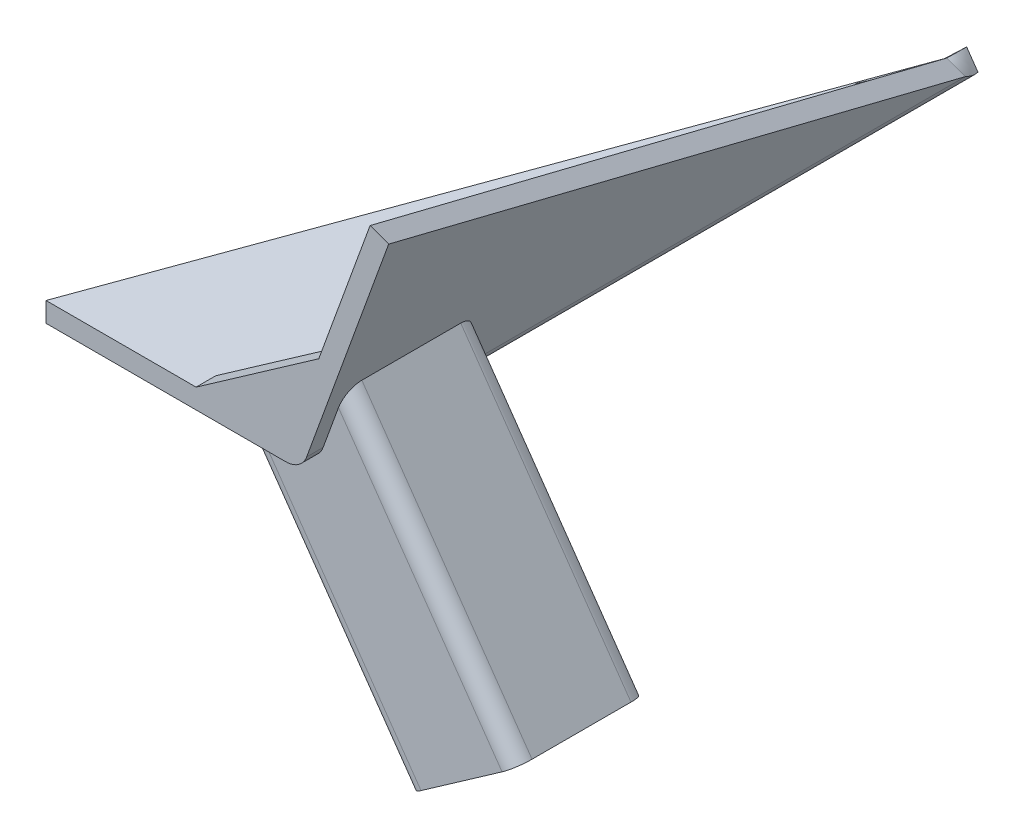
ISO-10303-21;
HEADER;
FILE_DESCRIPTION(('STEP AP214'),'2;1');
FILE_NAME('part.step','',(''),(''),'','','');
FILE_SCHEMA(('AUTOMOTIVE_DESIGN { 1 0 10303 214 1 1 1 1 }'));
ENDSEC;
DATA;
#1=APPLICATION_CONTEXT('core data for automotive mechanical design processes');
#2=APPLICATION_PROTOCOL_DEFINITION('international standard','automotive_design',2000,#1);
#3=PRODUCT_CONTEXT('',#1,'mechanical');
#4=PRODUCT('Part','Part','',(#3));
#5=PRODUCT_RELATED_PRODUCT_CATEGORY('part','',(#4));
#6=PRODUCT_DEFINITION_FORMATION('','',#4);
#7=PRODUCT_DEFINITION_CONTEXT('part definition',#1,'design');
#8=PRODUCT_DEFINITION('design','',#6,#7);
#9=PRODUCT_DEFINITION_SHAPE('','',#8);
#10=(LENGTH_UNIT() NAMED_UNIT(*) SI_UNIT(.MILLI.,.METRE.));
#11=(NAMED_UNIT(*) PLANE_ANGLE_UNIT() SI_UNIT($,.RADIAN.));
#12=(NAMED_UNIT(*) SI_UNIT($,.STERADIAN.) SOLID_ANGLE_UNIT());
#13=UNCERTAINTY_MEASURE_WITH_UNIT(LENGTH_MEASURE(1.E-05),#10,'distance_accuracy_value','');
#14=(GEOMETRIC_REPRESENTATION_CONTEXT(3) GLOBAL_UNCERTAINTY_ASSIGNED_CONTEXT((#13)) GLOBAL_UNIT_ASSIGNED_CONTEXT((#10,
#11,#12)) REPRESENTATION_CONTEXT('',''));
#15=CARTESIAN_POINT('',(0.,0.,0.));
#16=DIRECTION('',(0.,0.,1.));
#17=DIRECTION('',(1.,0.,0.));
#18=AXIS2_PLACEMENT_3D('',#15,#16,#17);
#19=CARTESIAN_POINT('',(10.1817775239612,30.6787063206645,-11.8));
#20=DIRECTION('',(0.573576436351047,-0.819152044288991,0.));
#21=DIRECTION('',(0.819152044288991,0.573576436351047,0.));
#22=AXIS2_PLACEMENT_3D('',#19,#20,#21);
#23=CYLINDRICAL_SURFACE('',#22,4.);
#24=CARTESIAN_POINT('',(46.4673193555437,-21.1424179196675,-11.8));
#25=DIRECTION('',(0.93969262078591,-0.342020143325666,0.));
#26=DIRECTION('',(-0.342020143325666,-0.939692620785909,0.));
#27=AXIS2_PLACEMENT_3D('',#24,#25,#26);
#28=ELLIPSE('',#27,4.88309835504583,4.);
#29=CARTESIAN_POINT('',(44.7972013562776,-25.7310294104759,-11.8));
#30=VERTEX_POINT('',#29);
#31=CARTESIAN_POINT('',(46.4673193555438,-21.1424179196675,-7.80000000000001));
#32=VERTEX_POINT('',#31);
#33=EDGE_CURVE('E12',#30,#32,#28,.F.);
#34=ORIENTED_EDGE('',*,*,#33,.F.);
#35=DIRECTION('',(0.573576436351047,-0.819152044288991,0.));
#36=VECTOR('',#35,1.);
#37=CARTESIAN_POINT('',(6.90516934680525,28.3844005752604,-11.8));
#38=LINE('',#37,#36);
#39=CARTESIAN_POINT('',(30.9813858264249,-6.,-11.8));
#40=VERTEX_POINT('',#39);
#41=EDGE_CURVE('E459',#40,#30,#38,.T.);
#42=ORIENTED_EDGE('',*,*,#41,.F.);
#43=CARTESIAN_POINT('',(35.8644841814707,-6.,-11.8));
#44=DIRECTION('',(0.,-1.,0.));
#45=DIRECTION('',(1.,0.,0.));
#46=AXIS2_PLACEMENT_3D('',#43,#44,#45);
#47=ELLIPSE('',#46,4.88309835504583,4.);
#48=CARTESIAN_POINT('',(35.8644841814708,-6.,-7.80000000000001));
#49=VERTEX_POINT('',#48);
#50=EDGE_CURVE('E397',#40,#49,#47,.F.);
#51=ORIENTED_EDGE('',*,*,#50,.T.);
#52=DIRECTION('',(0.573576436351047,-0.819152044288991,0.));
#53=VECTOR('',#52,1.);
#54=CARTESIAN_POINT('',(10.1817775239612,30.6787063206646,-7.80000000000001));
#55=LINE('',#54,#53);
#56=EDGE_CURVE('E379',#49,#32,#55,.T.);
#57=ORIENTED_EDGE('',*,*,#56,.T.);
#58=EDGE_LOOP('',(#34,#42,#51,#57));
#59=FACE_BOUND('',#58,.T.);
#60=ADVANCED_FACE('F67',(#59),#23,.F.);
#61=CARTESIAN_POINT('',(10.1817775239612,30.6787063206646,-7.80000000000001));
#62=DIRECTION('',(0.,0.,1.));
#63=DIRECTION('',(1.,0.,0.));
#64=AXIS2_PLACEMENT_3D('',#61,#62,#63);
#65=PLANE('',#64);
#66=DIRECTION('',(0.342020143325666,0.939692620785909,0.));
#67=VECTOR('',#66,1.);
#68=CARTESIAN_POINT('',(58.8777055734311,12.9548379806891,-7.80000000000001));
#69=LINE('',#68,#67);
#70=CARTESIAN_POINT('',(51.9787087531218,-6.,-7.80000000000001));
#71=VERTEX_POINT('',#70);
#72=EDGE_CURVE('E76',#32,#71,#69,.T.);
#73=ORIENTED_EDGE('',*,*,#72,.F.);
#74=ORIENTED_EDGE('',*,*,#56,.F.);
#75=DIRECTION('',(1.,0.,0.));
#76=VECTOR('',#75,1.);
#77=CARTESIAN_POINT('',(10.1817775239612,-6.,-7.80000000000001));
#78=LINE('',#77,#76);
#79=EDGE_CURVE('E393',#49,#71,#78,.T.);
#80=ORIENTED_EDGE('',*,*,#79,.T.);
#81=EDGE_LOOP('',(#73,#74,#80));
#82=FACE_BOUND('',#81,.T.);
#83=ADVANCED_FACE('F859',(#82),#65,.F.);
#84=CARTESIAN_POINT('',(10.1817775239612,30.6787063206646,-42.2));
#85=DIRECTION('',(0.,0.,-1.));
#86=DIRECTION('',(-1.,0.,0.));
#87=AXIS2_PLACEMENT_3D('',#84,#85,#86);
#88=PLANE('',#87);
#89=DIRECTION('',(-0.342020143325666,-0.939692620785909,0.));
#90=VECTOR('',#89,1.);
#91=CARTESIAN_POINT('',(58.877705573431,12.9548379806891,-42.2));
#92=LINE('',#91,#90);
#93=CARTESIAN_POINT('',(51.9787087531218,-5.99999999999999,-42.2));
#94=VERTEX_POINT('',#93);
#95=CARTESIAN_POINT('',(46.4673193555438,-21.1424179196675,-42.2));
#96=VERTEX_POINT('',#95);
#97=EDGE_CURVE('E89',#94,#96,#92,.T.);
#98=ORIENTED_EDGE('',*,*,#97,.F.);
#99=DIRECTION('',(-1.,0.,0.));
#100=VECTOR('',#99,1.);
#101=CARTESIAN_POINT('',(10.1817775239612,-6.,-42.2));
#102=LINE('',#101,#100);
#103=CARTESIAN_POINT('',(35.8644841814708,-6.,-42.2));
#104=VERTEX_POINT('',#103);
#105=EDGE_CURVE('E378',#94,#104,#102,.T.);
#106=ORIENTED_EDGE('',*,*,#105,.T.);
#107=DIRECTION('',(0.573576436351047,-0.819152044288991,0.));
#108=VECTOR('',#107,1.);
#109=CARTESIAN_POINT('',(10.1817775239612,30.6787063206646,-42.2));
#110=LINE('',#109,#108);
#111=EDGE_CURVE('E449',#104,#96,#110,.T.);
#112=ORIENTED_EDGE('',*,*,#111,.T.);
#113=EDGE_LOOP('',(#98,#106,#112));
#114=FACE_BOUND('',#113,.T.);
#115=ADVANCED_FACE('F873',(#114),#88,.F.);
#116=CARTESIAN_POINT('',(10.1817775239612,30.6787063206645,-38.2));
#117=DIRECTION('',(0.573576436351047,-0.819152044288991,0.));
#118=DIRECTION('',(0.819152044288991,0.573576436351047,0.));
#119=AXIS2_PLACEMENT_3D('',#116,#117,#118);
#120=CYLINDRICAL_SURFACE('',#119,4.);
#121=CARTESIAN_POINT('',(46.4673193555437,-21.1424179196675,-38.2));
#122=DIRECTION('',(0.93969262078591,-0.342020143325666,0.));
#123=DIRECTION('',(-0.342020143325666,-0.939692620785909,0.));
#124=AXIS2_PLACEMENT_3D('',#121,#122,#123);
#125=ELLIPSE('',#124,4.88309835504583,4.);
#126=CARTESIAN_POINT('',(44.7972013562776,-25.7310294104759,-38.2));
#127=VERTEX_POINT('',#126);
#128=EDGE_CURVE('E842',#96,#127,#125,.F.);
#129=ORIENTED_EDGE('',*,*,#128,.F.);
#130=ORIENTED_EDGE('',*,*,#111,.F.);
#131=CARTESIAN_POINT('',(35.8644841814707,-6.,-38.2));
#132=DIRECTION('',(0.,-1.,0.));
#133=DIRECTION('',(1.,0.,0.));
#134=AXIS2_PLACEMENT_3D('',#131,#132,#133);
#135=ELLIPSE('',#134,4.88309835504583,4.);
#136=CARTESIAN_POINT('',(30.9813858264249,-6.00000000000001,-38.2));
#137=VERTEX_POINT('',#136);
#138=EDGE_CURVE('E375',#104,#137,#135,.F.);
#139=ORIENTED_EDGE('',*,*,#138,.T.);
#140=DIRECTION('',(0.573576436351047,-0.819152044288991,0.));
#141=VECTOR('',#140,1.);
#142=CARTESIAN_POINT('',(6.90516934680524,28.3844005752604,-38.2));
#143=LINE('',#142,#141);
#144=EDGE_CURVE('E454',#137,#127,#143,.T.);
#145=ORIENTED_EDGE('',*,*,#144,.T.);
#146=EDGE_LOOP('',(#129,#130,#139,#145));
#147=FACE_BOUND('',#146,.T.);
#148=ADVANCED_FACE('F870',(#147),#120,.F.);
#149=CARTESIAN_POINT('',(6.90516934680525,28.3844005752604,-11.8));
#150=DIRECTION('',(-0.819152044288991,-0.573576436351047,0.));
#151=DIRECTION('',(0.573576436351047,-0.819152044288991,0.));
#152=AXIS2_PLACEMENT_3D('',#149,#150,#151);
#153=PLANE('',#152);
#154=DIRECTION('',(0.,0.,1.));
#155=VECTOR('',#154,1.);
#156=CARTESIAN_POINT('',(44.7972013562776,-25.7310294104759,-11.8000000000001));
#157=LINE('',#156,#155);
#158=EDGE_CURVE('E838',#127,#30,#157,.T.);
#159=ORIENTED_EDGE('',*,*,#158,.F.);
#160=ORIENTED_EDGE('',*,*,#144,.F.);
#161=DIRECTION('',(0.,0.,1.));
#162=VECTOR('',#161,1.);
#163=CARTESIAN_POINT('',(30.9813858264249,-6.,-11.8));
#164=LINE('',#163,#162);
#165=EDGE_CURVE('E400',#137,#40,#164,.T.);
#166=ORIENTED_EDGE('',*,*,#165,.T.);
#167=ORIENTED_EDGE('',*,*,#41,.T.);
#168=EDGE_LOOP('',(#159,#160,#166,#167));
#169=FACE_BOUND('',#168,.T.);
#170=ADVANCED_FACE('F867',(#169),#153,.F.);
#171=CARTESIAN_POINT('',(0.,-6.,0.));
#172=DIRECTION('',(0.,-1.,0.));
#173=DIRECTION('',(0.,0.,-1.));
#174=AXIS2_PLACEMENT_3D('',#171,#172,#173);
#175=PLANE('',#174);
#176=ORIENTED_EDGE('',*,*,#105,.F.);
#177=DIRECTION('',(0.,0.,1.));
#178=VECTOR('',#177,1.);
#179=CARTESIAN_POINT('',(51.9787087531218,-6.,0.));
#180=LINE('',#179,#178);
#181=EDGE_CURVE('E834',#94,#71,#180,.T.);
#182=ORIENTED_EDGE('',*,*,#181,.T.);
#183=ORIENTED_EDGE('',*,*,#79,.F.);
#184=ORIENTED_EDGE('',*,*,#50,.F.);
#185=ORIENTED_EDGE('',*,*,#165,.F.);
#186=ORIENTED_EDGE('',*,*,#138,.F.);
#187=EDGE_LOOP('',(#176,#182,#183,#184,#185,#186));
#188=FACE_BOUND('',#187,.T.);
#189=ADVANCED_FACE('F856',(#188),#175,.T.);
#190=CARTESIAN_POINT('',(35.8662114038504,-50.268722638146,0.));
#191=DIRECTION('',(0.93969262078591,-0.342020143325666,0.));
#192=DIRECTION('',(0.,0.,-1.));
#193=AXIS2_PLACEMENT_3D('',#190,#191,#192);
#194=PLANE('',#193);
#195=DIRECTION('',(0.,0.,1.));
#196=VECTOR('',#195,1.);
#197=CARTESIAN_POINT('',(60.3292987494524,16.9430574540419,-45.));
#198=LINE('',#197,#196);
#199=CARTESIAN_POINT('',(60.3292987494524,16.9430574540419,-40.));
#200=VERTEX_POINT('',#199);
#201=CARTESIAN_POINT('',(60.3292987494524,16.9430574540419,-10.));
#202=VERTEX_POINT('',#201);
#203=EDGE_CURVE('E495',#200,#202,#198,.T.);
#204=ORIENTED_EDGE('',*,*,#203,.F.);
#205=CARTESIAN_POINT('',(58.2416512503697,11.2072930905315,-40.));
#206=DIRECTION('',(0.93969262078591,-0.342020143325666,0.));
#207=DIRECTION('',(-0.342020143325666,-0.939692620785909,0.));
#208=AXIS2_PLACEMENT_3D('',#205,#206,#207);
#209=ELLIPSE('',#208,6.10387294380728,5.);
#210=CARTESIAN_POINT('',(58.2416512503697,11.2072930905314,-45.));
#211=VERTEX_POINT('',#210);
#212=EDGE_CURVE('E828',#200,#211,#209,.F.);
#213=ORIENTED_EDGE('',*,*,#212,.T.);
#214=DIRECTION('',(0.342020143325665,0.93969262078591,0.));
#215=VECTOR('',#214,1.);
#216=CARTESIAN_POINT('',(47.8267177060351,-17.4075016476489,-45.));
#217=LINE('',#216,#215);
#218=CARTESIAN_POINT('',(53.5920239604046,-1.56745289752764,-45.));
#219=VERTEX_POINT('',#218);
#220=EDGE_CURVE('E466',#219,#211,#217,.T.);
#221=ORIENTED_EDGE('',*,*,#220,.F.);
#222=DIRECTION('',(0.,0.,1.));
#223=VECTOR('',#222,1.);
#224=CARTESIAN_POINT('',(53.5920239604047,-1.56745289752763,0.));
#225=LINE('',#224,#223);
#226=CARTESIAN_POINT('',(53.5920239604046,-1.56745289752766,-199.789527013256));
#227=VERTEX_POINT('',#226);
#228=EDGE_CURVE('E967',#227,#219,#225,.T.);
#229=ORIENTED_EDGE('',*,*,#228,.F.);
#230=DIRECTION('',(-0.116977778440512,-0.321393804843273,-0.939692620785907));
#231=VECTOR('',#230,1.);
#232=CARTESIAN_POINT('',(78.462853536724,66.7645897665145,0.));
#233=LINE('',#232,#231);
#234=CARTESIAN_POINT('',(78.462853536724,66.7645897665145,0.));
#235=VERTEX_POINT('',#234);
#236=EDGE_CURVE('E1057',#235,#227,#233,.T.);
#237=ORIENTED_EDGE('',*,*,#236,.F.);
#238=DIRECTION('',(0.342020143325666,0.93969262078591,0.));
#239=VECTOR('',#238,1.);
#240=CARTESIAN_POINT('',(27.1598320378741,-74.1893033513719,0.));
#241=LINE('',#240,#239);
#242=CARTESIAN_POINT('',(53.5920239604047,-1.56745289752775,0.));
#243=VERTEX_POINT('',#242);
#244=EDGE_CURVE('E1051',#243,#235,#241,.T.);
#245=ORIENTED_EDGE('',*,*,#244,.F.);
#246=CARTESIAN_POINT('',(53.5920239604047,-1.56745289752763,-5.));
#247=VERTEX_POINT('',#246);
#248=EDGE_CURVE('E778',#247,#243,#225,.T.);
#249=ORIENTED_EDGE('',*,*,#248,.F.);
#250=DIRECTION('',(0.342020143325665,0.93969262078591,0.));
#251=VECTOR('',#250,1.);
#252=CARTESIAN_POINT('',(47.8267177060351,-17.4075016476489,-5.));
#253=LINE('',#252,#251);
#254=CARTESIAN_POINT('',(58.2416512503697,11.2072930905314,-5.));
#255=VERTEX_POINT('',#254);
#256=EDGE_CURVE('E465',#247,#255,#253,.T.);
#257=ORIENTED_EDGE('',*,*,#256,.T.);
#258=CARTESIAN_POINT('',(58.2416512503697,11.2072930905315,-10.));
#259=DIRECTION('',(0.93969262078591,-0.342020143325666,0.));
#260=DIRECTION('',(0.342020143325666,0.939692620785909,0.));
#261=AXIS2_PLACEMENT_3D('',#258,#259,#260);
#262=ELLIPSE('',#261,6.10387294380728,5.);
#263=EDGE_CURVE('E831',#255,#202,#262,.F.);
#264=ORIENTED_EDGE('',*,*,#263,.T.);
#265=EDGE_LOOP('',(#204,#213,#221,#229,#237,#245,#249,#257,#264));
#266=FACE_BOUND('',#265,.T.);
#267=ADVANCED_FACE('F952',(#266),#194,.T.);
#268=CARTESIAN_POINT('',(0.,-6.,0.));
#269=DIRECTION('',(0.,-1.,0.));
#270=DIRECTION('',(0.,0.,-1.));
#271=AXIS2_PLACEMENT_3D('',#268,#269,#270);
#272=PLANE('',#271);
#273=DIRECTION('',(0.,0.,1.));
#274=VECTOR('',#273,1.);
#275=CARTESIAN_POINT('',(47.2616906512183,-6.,0.));
#276=LINE('',#275,#274);
#277=CARTESIAN_POINT('',(47.2616906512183,-6.,-199.789527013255));
#278=VERTEX_POINT('',#277);
#279=CARTESIAN_POINT('',(47.2616906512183,-6.,-45.));
#280=VERTEX_POINT('',#279);
#281=EDGE_CURVE('E764',#278,#280,#276,.T.);
#282=ORIENTED_EDGE('',*,*,#281,.T.);
#283=DIRECTION('',(1.,0.,0.));
#284=VECTOR('',#283,1.);
#285=CARTESIAN_POINT('',(0.,-6.,-45.));
#286=LINE('',#285,#284);
#287=CARTESIAN_POINT('',(33.6670899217,-6.,-45.));
#288=VERTEX_POINT('',#287);
#289=EDGE_CURVE('E475',#288,#280,#286,.T.);
#290=ORIENTED_EDGE('',*,*,#289,.F.);
#291=CARTESIAN_POINT('',(33.6670899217,-6.,-40.));
#292=DIRECTION('',(0.,-1.,0.));
#293=DIRECTION('',(-1.,0.,0.));
#294=AXIS2_PLACEMENT_3D('',#291,#292,#293);
#295=ELLIPSE('',#294,6.10387294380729,5.);
#296=CARTESIAN_POINT('',(27.5632169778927,-6.,-40.));
#297=VERTEX_POINT('',#296);
#298=EDGE_CURVE('E822',#288,#297,#295,.F.);
#299=ORIENTED_EDGE('',*,*,#298,.T.);
#300=DIRECTION('',(0.,0.,1.));
#301=VECTOR('',#300,1.);
#302=CARTESIAN_POINT('',(27.5632169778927,-6.,-45.));
#303=LINE('',#302,#301);
#304=CARTESIAN_POINT('',(27.5632169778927,-6.,-10.));
#305=VERTEX_POINT('',#304);
#306=EDGE_CURVE('E482',#297,#305,#303,.T.);
#307=ORIENTED_EDGE('',*,*,#306,.T.);
#308=CARTESIAN_POINT('',(33.6670899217,-6.,-10.));
#309=DIRECTION('',(0.,-1.,0.));
#310=DIRECTION('',(1.,0.,0.));
#311=AXIS2_PLACEMENT_3D('',#308,#309,#310);
#312=ELLIPSE('',#311,6.10387294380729,5.);
#313=CARTESIAN_POINT('',(33.6670899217,-6.,-5.));
#314=VERTEX_POINT('',#313);
#315=EDGE_CURVE('E825',#305,#314,#312,.F.);
#316=ORIENTED_EDGE('',*,*,#315,.T.);
#317=DIRECTION('',(1.,0.,0.));
#318=VECTOR('',#317,1.);
#319=CARTESIAN_POINT('',(0.,-6.,-5.));
#320=LINE('',#319,#318);
#321=CARTESIAN_POINT('',(47.2616906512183,-6.,-5.));
#322=VERTEX_POINT('',#321);
#323=EDGE_CURVE('E489',#314,#322,#320,.T.);
#324=ORIENTED_EDGE('',*,*,#323,.T.);
#325=CARTESIAN_POINT('',(47.2616906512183,-6.,0.));
#326=VERTEX_POINT('',#325);
#327=EDGE_CURVE('E768',#322,#326,#276,.T.);
#328=ORIENTED_EDGE('',*,*,#327,.T.);
#329=DIRECTION('',(1.,0.,0.));
#330=VECTOR('',#329,1.);
#331=CARTESIAN_POINT('',(-25.455750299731,-6.,0.));
#332=LINE('',#331,#330);
#333=CARTESIAN_POINT('',(-25.455750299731,-6.,0.));
#334=VERTEX_POINT('',#333);
#335=EDGE_CURVE('E760',#334,#326,#332,.T.);
#336=ORIENTED_EDGE('',*,*,#335,.F.);
#337=DIRECTION('',(-0.342020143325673,0.,0.939692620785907));
#338=VECTOR('',#337,1.);
#339=CARTESIAN_POINT('',(49.544249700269,-6.,-206.060806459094));
#340=LINE('',#339,#338);
#341=EDGE_CURVE('E751',#278,#334,#340,.T.);
#342=ORIENTED_EDGE('',*,*,#341,.F.);
#343=EDGE_LOOP('',(#282,#290,#299,#307,#316,#324,#328,#336,#342));
#344=FACE_BOUND('',#343,.T.);
#345=ADVANCED_FACE('F700',(#344),#272,.T.);
#346=CARTESIAN_POINT('',(47.2616906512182,0.7366,-306.093445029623));
#347=DIRECTION('',(0.,0.,1.));
#348=DIRECTION('',(1.,0.,0.));
#349=AXIS2_PLACEMENT_3D('',#346,#347,#348);
#350=CYLINDRICAL_SURFACE('',#349,6.7366);
#351=ORIENTED_EDGE('',*,*,#228,.T.);
#352=CARTESIAN_POINT('',(47.2616906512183,0.7366,-45.));
#353=DIRECTION('',(0.,0.,1.));
#354=DIRECTION('',(1.,0.,0.));
#355=AXIS2_PLACEMENT_3D('',#352,#353,#354);
#356=CIRCLE('',#355,6.7366);
#357=EDGE_CURVE('E470',#280,#219,#356,.T.);
#358=ORIENTED_EDGE('',*,*,#357,.F.);
#359=ORIENTED_EDGE('',*,*,#281,.F.);
#360=CARTESIAN_POINT('',(51.1256456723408,-4.78169966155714,-206.060806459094));
#361=CARTESIAN_POINT('',(50.000783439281,-5.56933667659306,-203.968116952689));
#362=CARTESIAN_POINT('',(48.6348938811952,-6.,-201.882216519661));
#363=CARTESIAN_POINT('',(47.2616906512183,-6.,-199.789527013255));
#364=B_SPLINE_CURVE_WITH_KNOTS('',3,(#360,#361,#362,#363),.UNSPECIFIED.,.F.,.F.,(4,4),(0.,1.),.UNSPECIFIED.);
#365=CARTESIAN_POINT('',(51.1256456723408,-4.78169966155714,-206.060806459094));
#366=VERTEX_POINT('',#365);
#367=EDGE_CURVE('E658',#278,#366,#364,.F.);
#368=ORIENTED_EDGE('',*,*,#367,.T.);
#369=CARTESIAN_POINT('',(53.5920239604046,-1.5674528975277,-199.789527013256));
#370=CARTESIAN_POINT('',(53.1223607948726,-2.85784183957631,-201.882216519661));
#371=CARTESIAN_POINT('',(52.2505079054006,-3.99406264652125,-203.968116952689));
#372=CARTESIAN_POINT('',(51.1256456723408,-4.78169966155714,-206.060806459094));
#373=B_SPLINE_CURVE_WITH_KNOTS('',3,(#369,#370,#371,#372),.UNSPECIFIED.,.F.,.F.,(4,4),(0.,1.),.UNSPECIFIED.);
#374=EDGE_CURVE('E616',#366,#227,#373,.F.);
#375=ORIENTED_EDGE('',*,*,#374,.T.);
#376=EDGE_LOOP('',(#351,#358,#359,#368,#375));
#377=FACE_BOUND('',#376,.T.);
#378=ADVANCED_FACE('F636',(#377),#350,.T.);
#379=CARTESIAN_POINT('',(47.2616906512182,0.7366,-306.093445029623));
#380=DIRECTION('',(0.,0.,1.));
#381=DIRECTION('',(1.,0.,0.));
#382=AXIS2_PLACEMENT_3D('',#379,#380,#381);
#383=CYLINDRICAL_SURFACE('',#382,0.7366);
#384=CARTESIAN_POINT('',(47.2616906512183,0.7366,-180.));
#385=DIRECTION('',(0.,0.,1.));
#386=DIRECTION('',(1.,0.,0.));
#387=AXIS2_PLACEMENT_3D('',#384,#385,#386);
#388=CIRCLE('',#387,0.736599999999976);
#389=CARTESIAN_POINT('',(47.2616906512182,0.,-180.));
#390=VERTEX_POINT('',#389);
#391=CARTESIAN_POINT('',(47.9538682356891,0.484667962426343,-180.));
#392=VERTEX_POINT('',#391);
#393=EDGE_CURVE('E499',#390,#392,#388,.T.);
#394=ORIENTED_EDGE('',*,*,#393,.T.);
#395=DIRECTION('',(0.,0.,1.));
#396=VECTOR('',#395,1.);
#397=CARTESIAN_POINT('',(47.9538682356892,0.484667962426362,0.));
#398=LINE('',#397,#396);
#399=CARTESIAN_POINT('',(47.9538682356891,0.484667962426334,-199.789527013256));
#400=VERTEX_POINT('',#399);
#401=EDGE_CURVE('E1017',#400,#392,#398,.T.);
#402=ORIENTED_EDGE('',*,*,#401,.F.);
#403=CARTESIAN_POINT('',(47.6841870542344,0.133212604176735,-206.060806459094));
#404=CARTESIAN_POINT('',(47.80705247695,0.219243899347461,-203.970335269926));
#405=CARTESIAN_POINT('',(47.902568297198,0.34372253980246,-201.879998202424));
#406=CARTESIAN_POINT('',(47.9538682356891,0.484667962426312,-199.789527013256));
#407=B_SPLINE_CURVE_WITH_KNOTS('',3,(#403,#404,#405,#406),.UNSPECIFIED.,.F.,.F.,(4,4),(0.,1.),.UNSPECIFIED.);
#408=CARTESIAN_POINT('',(47.6841870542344,0.133212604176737,-206.060806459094));
#409=VERTEX_POINT('',#408);
#410=EDGE_CURVE('E1074',#409,#400,#407,.T.);
#411=ORIENTED_EDGE('',*,*,#410,.F.);
#412=CARTESIAN_POINT('',(47.2616906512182,0.,-199.789527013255));
#413=CARTESIAN_POINT('',(47.4116816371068,0.,-201.879998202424));
#414=CARTESIAN_POINT('',(47.5613216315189,0.0471813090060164,-203.970335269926));
#415=CARTESIAN_POINT('',(47.6841870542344,0.133212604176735,-206.060806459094));
#416=B_SPLINE_CURVE_WITH_KNOTS('',3,(#412,#413,#414,#415),.UNSPECIFIED.,.F.,.F.,(4,4),(0.,1.),.UNSPECIFIED.);
#417=CARTESIAN_POINT('',(47.2616906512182,0.,-199.789527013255));
#418=VERTEX_POINT('',#417);
#419=EDGE_CURVE('E607',#418,#409,#416,.T.);
#420=ORIENTED_EDGE('',*,*,#419,.F.);
#421=DIRECTION('',(0.,0.,1.));
#422=VECTOR('',#421,1.);
#423=CARTESIAN_POINT('',(47.2616906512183,0.,0.));
#424=LINE('',#423,#422);
#425=EDGE_CURVE('E777',#418,#390,#424,.T.);
#426=ORIENTED_EDGE('',*,*,#425,.T.);
#427=EDGE_LOOP('',(#394,#402,#411,#420,#426));
#428=FACE_BOUND('',#427,.T.);
#429=ADVANCED_FACE('F1125',(#428),#383,.F.);
#430=CARTESIAN_POINT('',(47.9538682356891,0.484667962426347,-174.));
#431=VERTEX_POINT('',#430);
#432=CARTESIAN_POINT('',(47.9538682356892,0.484667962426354,-100.));
#433=VERTEX_POINT('',#432);
#434=EDGE_CURVE('E1026',#431,#433,#398,.T.);
#435=ORIENTED_EDGE('',*,*,#434,.F.);
#436=CARTESIAN_POINT('',(47.2616906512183,0.7366,-174.));
#437=DIRECTION('',(0.,0.,1.));
#438=DIRECTION('',(1.,0.,0.));
#439=AXIS2_PLACEMENT_3D('',#436,#437,#438);
#440=CIRCLE('',#439,0.736599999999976);
#441=CARTESIAN_POINT('',(47.2616906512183,0.,-174.));
#442=VERTEX_POINT('',#441);
#443=EDGE_CURVE('E511',#442,#431,#440,.T.);
#444=ORIENTED_EDGE('',*,*,#443,.F.);
#445=CARTESIAN_POINT('',(47.2616906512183,0.,-100.));
#446=VERTEX_POINT('',#445);
#447=EDGE_CURVE('E1040',#442,#446,#424,.T.);
#448=ORIENTED_EDGE('',*,*,#447,.T.);
#449=CARTESIAN_POINT('',(47.2616906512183,0.7366,-100.));
#450=DIRECTION('',(0.,0.,1.));
#451=DIRECTION('',(1.,0.,0.));
#452=AXIS2_PLACEMENT_3D('',#449,#450,#451);
#453=CIRCLE('',#452,0.736599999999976);
#454=EDGE_CURVE('E552',#446,#433,#453,.T.);
#455=ORIENTED_EDGE('',*,*,#454,.T.);
#456=EDGE_LOOP('',(#435,#444,#448,#455));
#457=FACE_BOUND('',#456,.T.);
#458=ADVANCED_FACE('F1114',(#457),#383,.F.);
#459=CARTESIAN_POINT('',(47.9538682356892,0.484667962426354,-94.));
#460=VERTEX_POINT('',#459);
#461=CARTESIAN_POINT('',(47.9538682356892,0.484667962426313,-6.));
#462=VERTEX_POINT('',#461);
#463=EDGE_CURVE('E1033',#460,#462,#398,.T.);
#464=ORIENTED_EDGE('',*,*,#463,.F.);
#465=CARTESIAN_POINT('',(47.2616906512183,0.7366,-94.));
#466=DIRECTION('',(0.,0.,1.));
#467=DIRECTION('',(1.,0.,0.));
#468=AXIS2_PLACEMENT_3D('',#465,#466,#467);
#469=CIRCLE('',#468,0.736599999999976);
#470=CARTESIAN_POINT('',(47.2616906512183,0.,-94.));
#471=VERTEX_POINT('',#470);
#472=EDGE_CURVE('E560',#471,#460,#469,.T.);
#473=ORIENTED_EDGE('',*,*,#472,.F.);
#474=CARTESIAN_POINT('',(47.2616906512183,0.,-6.));
#475=VERTEX_POINT('',#474);
#476=EDGE_CURVE('E1038',#471,#475,#424,.T.);
#477=ORIENTED_EDGE('',*,*,#476,.T.);
#478=CARTESIAN_POINT('',(47.2616906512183,0.7366,-6.));
#479=DIRECTION('',(0.,0.,1.));
#480=DIRECTION('',(1.,0.,0.));
#481=AXIS2_PLACEMENT_3D('',#478,#479,#480);
#482=CIRCLE('',#481,0.736599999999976);
#483=EDGE_CURVE('E585',#475,#462,#482,.T.);
#484=ORIENTED_EDGE('',*,*,#483,.T.);
#485=EDGE_LOOP('',(#464,#473,#477,#484));
#486=FACE_BOUND('',#485,.T.);
#487=ADVANCED_FACE('F638',(#486),#383,.F.);
#488=CARTESIAN_POINT('',(30.228055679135,-48.216601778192,0.));
#489=DIRECTION('',(0.93969262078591,-0.342020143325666,0.));
#490=DIRECTION('',(0.,0.,-1.));
#491=AXIS2_PLACEMENT_3D('',#488,#489,#490);
#492=PLANE('',#491);
#493=DIRECTION('',(0.,0.,-1.));
#494=VECTOR('',#493,1.);
#495=CARTESIAN_POINT('',(50.2799195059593,6.87544130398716,-174.));
#496=LINE('',#495,#494);
#497=CARTESIAN_POINT('',(50.2799195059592,6.87544130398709,-174.));
#498=VERTEX_POINT('',#497);
#499=CARTESIAN_POINT('',(50.2799195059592,6.87544130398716,-180.));
#500=VERTEX_POINT('',#499);
#501=EDGE_CURVE('E542',#498,#500,#496,.T.);
#502=ORIENTED_EDGE('',*,*,#501,.F.);
#503=DIRECTION('',(0.342020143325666,0.93969262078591,0.));
#504=VECTOR('',#503,1.);
#505=CARTESIAN_POINT('',(47.9538682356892,0.484667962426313,-174.));
#506=LINE('',#505,#504);
#507=EDGE_CURVE('E515',#431,#498,#506,.T.);
#508=ORIENTED_EDGE('',*,*,#507,.F.);
#509=ORIENTED_EDGE('',*,*,#434,.T.);
#510=DIRECTION('',(0.342020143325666,0.939692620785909,0.));
#511=VECTOR('',#510,1.);
#512=CARTESIAN_POINT('',(47.9538682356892,0.484667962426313,-100.));
#513=LINE('',#512,#511);
#514=CARTESIAN_POINT('',(57.2580733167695,26.0477613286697,-100.));
#515=VERTEX_POINT('',#514);
#516=EDGE_CURVE('E546',#433,#515,#513,.T.);
#517=ORIENTED_EDGE('',*,*,#516,.T.);
#518=DIRECTION('',(0.,0.,-1.));
#519=VECTOR('',#518,1.);
#520=CARTESIAN_POINT('',(57.2580733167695,26.0477613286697,-94.));
#521=LINE('',#520,#519);
#522=CARTESIAN_POINT('',(57.2580733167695,26.0477613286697,-94.));
#523=VERTEX_POINT('',#522);
#524=EDGE_CURVE('E580',#523,#515,#521,.T.);
#525=ORIENTED_EDGE('',*,*,#524,.F.);
#526=DIRECTION('',(0.342020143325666,0.939692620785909,0.));
#527=VECTOR('',#526,1.);
#528=CARTESIAN_POINT('',(47.9538682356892,0.484667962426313,-94.));
#529=LINE('',#528,#527);
#530=EDGE_CURVE('E547',#460,#523,#529,.T.);
#531=ORIENTED_EDGE('',*,*,#530,.F.);
#532=ORIENTED_EDGE('',*,*,#463,.T.);
#533=DIRECTION('',(0.342020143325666,0.939692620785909,0.));
#534=VECTOR('',#533,1.);
#535=CARTESIAN_POINT('',(47.9538682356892,0.484667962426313,-6.));
#536=LINE('',#535,#534);
#537=CARTESIAN_POINT('',(57.2580733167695,26.0477613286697,-6.));
#538=VERTEX_POINT('',#537);
#539=EDGE_CURVE('E589',#462,#538,#536,.T.);
#540=ORIENTED_EDGE('',*,*,#539,.T.);
#541=DIRECTION('',(0.,0.,1.));
#542=VECTOR('',#541,1.);
#543=CARTESIAN_POINT('',(57.2580733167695,26.0477613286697,-6.));
#544=LINE('',#543,#542);
#545=CARTESIAN_POINT('',(57.2580733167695,26.0477613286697,0.));
#546=VERTEX_POINT('',#545);
#547=EDGE_CURVE('E600',#538,#546,#544,.T.);
#548=ORIENTED_EDGE('',*,*,#547,.T.);
#549=DIRECTION('',(0.342020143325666,0.93969262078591,0.));
#550=VECTOR('',#549,1.);
#551=CARTESIAN_POINT('',(21.5216763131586,-72.1371824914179,0.));
#552=LINE('',#551,#550);
#553=CARTESIAN_POINT('',(72.8246978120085,68.8167106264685,0.));
#554=VERTEX_POINT('',#553);
#555=EDGE_CURVE('E1054',#546,#554,#552,.T.);
#556=ORIENTED_EDGE('',*,*,#555,.T.);
#557=DIRECTION('',(-0.116977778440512,-0.321393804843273,-0.939692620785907));
#558=VECTOR('',#557,1.);
#559=CARTESIAN_POINT('',(72.8246978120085,68.8167106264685,0.));
#560=LINE('',#559,#558);
#561=EDGE_CURVE('E750',#554,#400,#560,.T.);
#562=ORIENTED_EDGE('',*,*,#561,.T.);
#563=ORIENTED_EDGE('',*,*,#401,.T.);
#564=DIRECTION('',(0.342020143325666,0.93969262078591,0.));
#565=VECTOR('',#564,1.);
#566=CARTESIAN_POINT('',(47.9538682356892,0.484667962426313,-180.));
#567=LINE('',#566,#565);
#568=EDGE_CURVE('E531',#392,#500,#567,.T.);
#569=ORIENTED_EDGE('',*,*,#568,.T.);
#570=EDGE_LOOP('',(#502,#508,#509,#517,#525,#531,#532,#540,#548,#556,#562,#563,#569));
#571=FACE_BOUND('',#570,.T.);
#572=ADVANCED_FACE('F1000',(#571),#492,.F.);
#573=CARTESIAN_POINT('',(78.462853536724,66.7645897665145,0.));
#574=DIRECTION('',(0.321393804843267,0.883022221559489,-0.342020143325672));
#575=DIRECTION('',(-0.116977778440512,-0.321393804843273,-0.939692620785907));
#576=AXIS2_PLACEMENT_3D('',#573,#574,#575);
#577=PLANE('',#576);
#578=CARTESIAN_POINT('',(47.9538682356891,0.484667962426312,-199.789527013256));
#579=CARTESIAN_POINT('',(53.5920239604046,-1.5674528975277,-199.789527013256));
#580=B_SPLINE_CURVE_WITH_KNOTS('',1,(#578,#579),.UNSPECIFIED.,.F.,.F.,(2,2),(0.,1.),.UNSPECIFIED.);
#581=EDGE_CURVE('E785',#400,#227,#580,.T.);
#582=ORIENTED_EDGE('',*,*,#581,.F.);
#583=ORIENTED_EDGE('',*,*,#561,.F.);
#584=DIRECTION('',(-0.93969262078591,0.342020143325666,0.));
#585=VECTOR('',#584,1.);
#586=CARTESIAN_POINT('',(78.462853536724,66.7645897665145,0.));
#587=LINE('',#586,#585);
#588=EDGE_CURVE('E1045',#235,#554,#587,.T.);
#589=ORIENTED_EDGE('',*,*,#588,.F.);
#590=ORIENTED_EDGE('',*,*,#236,.T.);
#591=EDGE_LOOP('',(#582,#583,#589,#590));
#592=FACE_BOUND('',#591,.T.);
#593=ADVANCED_FACE('F998',(#592),#577,.T.);
#594=CARTESIAN_POINT('',(27.1598320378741,-74.1893033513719,0.));
#595=DIRECTION('',(0.,0.,1.));
#596=DIRECTION('',(0.342020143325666,0.93969262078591,0.));
#597=AXIS2_PLACEMENT_3D('',#594,#595,#596);
#598=PLANE('',#597);
#599=ORIENTED_EDGE('',*,*,#244,.T.);
#600=ORIENTED_EDGE('',*,*,#588,.T.);
#601=ORIENTED_EDGE('',*,*,#555,.F.);
#602=DIRECTION('',(-0.819152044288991,-0.573576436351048,0.));
#603=VECTOR('',#602,1.);
#604=CARTESIAN_POINT('',(57.2580733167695,26.0477613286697,0.));
#605=LINE('',#604,#603);
#606=CARTESIAN_POINT('',(20.0580148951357,0.,0.));
#607=VERTEX_POINT('',#606);
#608=EDGE_CURVE('E584',#546,#607,#605,.T.);
#609=ORIENTED_EDGE('',*,*,#608,.T.);
#610=DIRECTION('',(1.,0.,0.));
#611=VECTOR('',#610,1.);
#612=CARTESIAN_POINT('',(-25.455750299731,0.,0.));
#613=LINE('',#612,#611);
#614=CARTESIAN_POINT('',(-25.455750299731,0.,0.));
#615=VERTEX_POINT('',#614);
#616=EDGE_CURVE('E752',#615,#607,#613,.T.);
#617=ORIENTED_EDGE('',*,*,#616,.F.);
#618=DIRECTION('',(0.,1.,0.));
#619=VECTOR('',#618,1.);
#620=CARTESIAN_POINT('',(-25.455750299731,-6.,0.));
#621=LINE('',#620,#619);
#622=EDGE_CURVE('E741',#334,#615,#621,.T.);
#623=ORIENTED_EDGE('',*,*,#622,.F.);
#624=ORIENTED_EDGE('',*,*,#335,.T.);
#625=CARTESIAN_POINT('',(47.2616906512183,0.7366,0.));
#626=DIRECTION('',(0.,0.,-1.));
#627=DIRECTION('',(1.,0.,0.));
#628=AXIS2_PLACEMENT_3D('',#625,#626,#627);
#629=CIRCLE('',#628,6.7366);
#630=EDGE_CURVE('E611',#243,#326,#629,.T.);
#631=ORIENTED_EDGE('',*,*,#630,.F.);
#632=EDGE_LOOP('',(#599,#600,#601,#609,#617,#623,#624,#631));
#633=FACE_BOUND('',#632,.T.);
#634=ADVANCED_FACE('F995',(#633),#598,.T.);
#635=CARTESIAN_POINT('',(0.,0.,0.));
#636=DIRECTION('',(0.,-1.,0.));
#637=DIRECTION('',(0.,0.,-1.));
#638=AXIS2_PLACEMENT_3D('',#635,#636,#637);
#639=PLANE('',#638);
#640=ORIENTED_EDGE('',*,*,#447,.F.);
#641=DIRECTION('',(1.,0.,0.));
#642=VECTOR('',#641,1.);
#643=CARTESIAN_POINT('',(40.4607717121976,0.,-174.));
#644=LINE('',#643,#642);
#645=CARTESIAN_POINT('',(40.4607717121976,0.,-174.));
#646=VERTEX_POINT('',#645);
#647=EDGE_CURVE('E524',#646,#442,#644,.T.);
#648=ORIENTED_EDGE('',*,*,#647,.F.);
#649=DIRECTION('',(0.,0.,-1.));
#650=VECTOR('',#649,1.);
#651=CARTESIAN_POINT('',(40.4607717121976,0.,-174.));
#652=LINE('',#651,#650);
#653=CARTESIAN_POINT('',(40.4607717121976,0.,-180.));
#654=VERTEX_POINT('',#653);
#655=EDGE_CURVE('E528',#646,#654,#652,.T.);
#656=ORIENTED_EDGE('',*,*,#655,.T.);
#657=DIRECTION('',(1.,0.,0.));
#658=VECTOR('',#657,1.);
#659=CARTESIAN_POINT('',(40.4607717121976,0.,-180.));
#660=LINE('',#659,#658);
#661=EDGE_CURVE('E516',#654,#390,#660,.T.);
#662=ORIENTED_EDGE('',*,*,#661,.T.);
#663=ORIENTED_EDGE('',*,*,#425,.F.);
#664=DIRECTION('',(-0.342020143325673,0.,0.939692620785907));
#665=VECTOR('',#664,1.);
#666=CARTESIAN_POINT('',(49.544249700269,0.,-206.060806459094));
#667=LINE('',#666,#665);
#668=EDGE_CURVE('E756',#418,#615,#667,.T.);
#669=ORIENTED_EDGE('',*,*,#668,.T.);
#670=ORIENTED_EDGE('',*,*,#616,.T.);
#671=DIRECTION('',(0.,0.,1.));
#672=VECTOR('',#671,1.);
#673=CARTESIAN_POINT('',(20.0580148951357,0.,-6.));
#674=LINE('',#673,#672);
#675=CARTESIAN_POINT('',(20.0580148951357,0.,-6.));
#676=VERTEX_POINT('',#675);
#677=EDGE_CURVE('E604',#676,#607,#674,.T.);
#678=ORIENTED_EDGE('',*,*,#677,.F.);
#679=DIRECTION('',(1.,0.,0.));
#680=VECTOR('',#679,1.);
#681=CARTESIAN_POINT('',(20.0580148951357,0.,-6.));
#682=LINE('',#681,#680);
#683=EDGE_CURVE('E596',#676,#475,#682,.T.);
#684=ORIENTED_EDGE('',*,*,#683,.T.);
#685=ORIENTED_EDGE('',*,*,#476,.F.);
#686=DIRECTION('',(1.,0.,0.));
#687=VECTOR('',#686,1.);
#688=CARTESIAN_POINT('',(20.0580148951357,0.,-94.));
#689=LINE('',#688,#687);
#690=CARTESIAN_POINT('',(20.0580148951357,0.,-94.));
#691=VERTEX_POINT('',#690);
#692=EDGE_CURVE('E556',#691,#471,#689,.T.);
#693=ORIENTED_EDGE('',*,*,#692,.F.);
#694=DIRECTION('',(0.,0.,-1.));
#695=VECTOR('',#694,1.);
#696=CARTESIAN_POINT('',(20.0580148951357,0.,-94.));
#697=LINE('',#696,#695);
#698=CARTESIAN_POINT('',(20.0580148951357,0.,-100.));
#699=VERTEX_POINT('',#698);
#700=EDGE_CURVE('E564',#691,#699,#697,.T.);
#701=ORIENTED_EDGE('',*,*,#700,.T.);
#702=DIRECTION('',(1.,0.,0.));
#703=VECTOR('',#702,1.);
#704=CARTESIAN_POINT('',(20.0580148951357,0.,-100.));
#705=LINE('',#704,#703);
#706=EDGE_CURVE('E571',#699,#446,#705,.T.);
#707=ORIENTED_EDGE('',*,*,#706,.T.);
#708=EDGE_LOOP('',(#640,#648,#656,#662,#663,#669,#670,#678,#684,#685,#693,#701,#707));
#709=FACE_BOUND('',#708,.T.);
#710=ADVANCED_FACE('F992',(#709),#639,.F.);
#711=CARTESIAN_POINT('',(49.544249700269,-6.,-206.060806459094));
#712=DIRECTION('',(-0.939692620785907,0.,-0.342020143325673));
#713=DIRECTION('',(-0.342020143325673,0.,0.939692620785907));
#714=AXIS2_PLACEMENT_3D('',#711,#712,#713);
#715=PLANE('',#714);
#716=ORIENTED_EDGE('',*,*,#668,.F.);
#717=CARTESIAN_POINT('',(47.2616906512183,-6.,-199.789527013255));
#718=CARTESIAN_POINT('',(47.2616906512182,0.,-199.789527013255));
#719=B_SPLINE_CURVE_WITH_KNOTS('',1,(#717,#718),.UNSPECIFIED.,.F.,.F.,(2,2),(0.,1.),.UNSPECIFIED.);
#720=EDGE_CURVE('E737',#418,#278,#719,.F.);
#721=ORIENTED_EDGE('',*,*,#720,.T.);
#722=ORIENTED_EDGE('',*,*,#341,.T.);
#723=ORIENTED_EDGE('',*,*,#622,.T.);
#724=EDGE_LOOP('',(#716,#721,#722,#723));
#725=FACE_BOUND('',#724,.T.);
#726=ADVANCED_FACE('F696',(#725),#715,.T.);
#727=CARTESIAN_POINT('',(47.2616906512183,-6.,-199.789527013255));
#728=CARTESIAN_POINT('',(48.6348938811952,-6.,-201.882216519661));
#729=CARTESIAN_POINT('',(50.000783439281,-5.56933667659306,-203.968116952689));
#730=CARTESIAN_POINT('',(51.1256456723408,-4.78169966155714,-206.060806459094));
#731=CARTESIAN_POINT('',(47.2616906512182,0.,-199.789527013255));
#732=CARTESIAN_POINT('',(47.4116816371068,0.,-201.879998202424));
#733=CARTESIAN_POINT('',(47.5613216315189,0.0471813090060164,-203.970335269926));
#734=CARTESIAN_POINT('',(47.6841870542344,0.133212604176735,-206.060806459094));
#735=B_SPLINE_SURFACE_WITH_KNOTS('',1,3,((#727,#728,#729,#730),(#731,#732,#733,#734)),
.UNSPECIFIED.,.F.,.F.,.F.,(2,2),(4,4),(0.,1.),(0.,1.),.UNSPECIFIED.);
#736=CARTESIAN_POINT('',(47.6841870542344,0.133212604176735,-206.060806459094));
#737=CARTESIAN_POINT('',(51.1256456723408,-4.78169966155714,-206.060806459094));
#738=B_SPLINE_CURVE_WITH_KNOTS('',1,(#736,#737),.UNSPECIFIED.,.F.,.F.,(2,2),(0.,1.),.UNSPECIFIED.);
#739=EDGE_CURVE('E615',#409,#366,#738,.T.);
#740=ORIENTED_EDGE('',*,*,#720,.F.);
#741=ORIENTED_EDGE('',*,*,#419,.T.);
#742=ORIENTED_EDGE('',*,*,#739,.T.);
#743=ORIENTED_EDGE('',*,*,#367,.F.);
#744=EDGE_LOOP('',(#740,#741,#742,#743));
#745=FACE_BOUND('',#744,.T.);
#746=ADVANCED_FACE('F685',(#745),#735,.T.);
#747=CARTESIAN_POINT('',(51.1256456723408,-4.78169966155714,-206.060806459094));
#748=CARTESIAN_POINT('',(52.2505079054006,-3.99406264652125,-203.968116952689));
#749=CARTESIAN_POINT('',(53.1223607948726,-2.85784183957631,-201.882216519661));
#750=CARTESIAN_POINT('',(53.5920239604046,-1.5674528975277,-199.789527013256));
#751=CARTESIAN_POINT('',(47.6841870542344,0.133212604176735,-206.060806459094));
#752=CARTESIAN_POINT('',(47.80705247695,0.219243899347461,-203.970335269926));
#753=CARTESIAN_POINT('',(47.902568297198,0.34372253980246,-201.879998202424));
#754=CARTESIAN_POINT('',(47.9538682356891,0.484667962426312,-199.789527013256));
#755=B_SPLINE_SURFACE_WITH_KNOTS('',1,3,((#747,#748,#749,#750),(#751,#752,#753,#754)),
.UNSPECIFIED.,.F.,.F.,.F.,(2,2),(4,4),(0.,1.),(0.,1.),.UNSPECIFIED.);
#756=ORIENTED_EDGE('',*,*,#739,.F.);
#757=ORIENTED_EDGE('',*,*,#410,.T.);
#758=ORIENTED_EDGE('',*,*,#581,.T.);
#759=ORIENTED_EDGE('',*,*,#374,.F.);
#760=EDGE_LOOP('',(#756,#757,#758,#759));
#761=FACE_BOUND('',#760,.T.);
#762=ADVANCED_FACE('F634',(#761),#755,.T.);
#763=CARTESIAN_POINT('',(47.2616906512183,0.7366,-5.));
#764=DIRECTION('',(0.,0.,1.));
#765=DIRECTION('',(1.,0.,0.));
#766=AXIS2_PLACEMENT_3D('',#763,#764,#765);
#767=CIRCLE('',#766,6.7366);
#768=EDGE_CURVE('E486',#322,#247,#767,.T.);
#769=ORIENTED_EDGE('',*,*,#768,.T.);
#770=ORIENTED_EDGE('',*,*,#248,.T.);
#771=ORIENTED_EDGE('',*,*,#630,.T.);
#772=ORIENTED_EDGE('',*,*,#327,.F.);
#773=EDGE_LOOP('',(#769,#770,#771,#772));
#774=FACE_BOUND('',#773,.T.);
#775=ADVANCED_FACE('F623',(#774),#350,.T.);
#776=CARTESIAN_POINT('',(57.2580733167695,26.0477613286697,-6.));
#777=DIRECTION('',(-0.573576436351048,0.81915204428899,0.));
#778=DIRECTION('',(-0.819152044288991,-0.573576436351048,0.));
#779=AXIS2_PLACEMENT_3D('',#776,#777,#778);
#780=PLANE('',#779);
#781=ORIENTED_EDGE('',*,*,#608,.F.);
#782=ORIENTED_EDGE('',*,*,#547,.F.);
#783=DIRECTION('',(-0.819152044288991,-0.573576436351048,0.));
#784=VECTOR('',#783,1.);
#785=CARTESIAN_POINT('',(57.2580733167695,26.0477613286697,-6.));
#786=LINE('',#785,#784);
#787=EDGE_CURVE('E593',#538,#676,#786,.T.);
#788=ORIENTED_EDGE('',*,*,#787,.T.);
#789=ORIENTED_EDGE('',*,*,#677,.T.);
#790=EDGE_LOOP('',(#781,#782,#788,#789));
#791=FACE_BOUND('',#790,.T.);
#792=ADVANCED_FACE('F633',(#791),#780,.T.);
#793=CARTESIAN_POINT('',(47.2616906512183,0.7366,-6.));
#794=DIRECTION('',(0.,0.,1.));
#795=DIRECTION('',(1.,0.,0.));
#796=AXIS2_PLACEMENT_3D('',#793,#794,#795);
#797=PLANE('',#796);
#798=ORIENTED_EDGE('',*,*,#483,.F.);
#799=ORIENTED_EDGE('',*,*,#683,.F.);
#800=ORIENTED_EDGE('',*,*,#787,.F.);
#801=ORIENTED_EDGE('',*,*,#539,.F.);
#802=EDGE_LOOP('',(#798,#799,#800,#801));
#803=FACE_BOUND('',#802,.T.);
#804=ADVANCED_FACE('F1092',(#803),#797,.F.);
#805=CARTESIAN_POINT('',(57.2580733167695,26.0477613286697,-94.));
#806=DIRECTION('',(0.573576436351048,-0.81915204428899,0.));
#807=DIRECTION('',(0.819152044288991,0.573576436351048,0.));
#808=AXIS2_PLACEMENT_3D('',#805,#806,#807);
#809=PLANE('',#808);
#810=DIRECTION('',(-0.819152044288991,-0.573576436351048,0.));
#811=VECTOR('',#810,1.);
#812=CARTESIAN_POINT('',(57.2580733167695,26.0477613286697,-100.));
#813=LINE('',#812,#811);
#814=EDGE_CURVE('E567',#515,#699,#813,.T.);
#815=ORIENTED_EDGE('',*,*,#814,.T.);
#816=ORIENTED_EDGE('',*,*,#700,.F.);
#817=DIRECTION('',(-0.819152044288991,-0.573576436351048,0.));
#818=VECTOR('',#817,1.);
#819=CARTESIAN_POINT('',(57.2580733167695,26.0477613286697,-94.));
#820=LINE('',#819,#818);
#821=EDGE_CURVE('E551',#523,#691,#820,.T.);
#822=ORIENTED_EDGE('',*,*,#821,.F.);
#823=ORIENTED_EDGE('',*,*,#524,.T.);
#824=EDGE_LOOP('',(#815,#816,#822,#823));
#825=FACE_BOUND('',#824,.T.);
#826=ADVANCED_FACE('F1108',(#825),#809,.F.);
#827=CARTESIAN_POINT('',(47.2616906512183,0.7366,-94.));
#828=DIRECTION('',(0.,0.,1.));
#829=DIRECTION('',(1.,0.,0.));
#830=AXIS2_PLACEMENT_3D('',#827,#828,#829);
#831=PLANE('',#830);
#832=ORIENTED_EDGE('',*,*,#530,.T.);
#833=ORIENTED_EDGE('',*,*,#821,.T.);
#834=ORIENTED_EDGE('',*,*,#692,.T.);
#835=ORIENTED_EDGE('',*,*,#472,.T.);
#836=EDGE_LOOP('',(#832,#833,#834,#835));
#837=FACE_BOUND('',#836,.T.);
#838=ADVANCED_FACE('F1101',(#837),#831,.T.);
#839=CARTESIAN_POINT('',(47.2616906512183,0.7366,-100.));
#840=DIRECTION('',(0.,0.,1.));
#841=DIRECTION('',(1.,0.,0.));
#842=AXIS2_PLACEMENT_3D('',#839,#840,#841);
#843=PLANE('',#842);
#844=ORIENTED_EDGE('',*,*,#516,.F.);
#845=ORIENTED_EDGE('',*,*,#454,.F.);
#846=ORIENTED_EDGE('',*,*,#706,.F.);
#847=ORIENTED_EDGE('',*,*,#814,.F.);
#848=EDGE_LOOP('',(#844,#845,#846,#847));
#849=FACE_BOUND('',#848,.T.);
#850=ADVANCED_FACE('F1111',(#849),#843,.F.);
#851=CARTESIAN_POINT('',(40.4607717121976,0.,-174.));
#852=DIRECTION('',(0.573576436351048,-0.81915204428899,0.));
#853=DIRECTION('',(0.819152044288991,0.573576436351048,0.));
#854=AXIS2_PLACEMENT_3D('',#851,#852,#853);
#855=PLANE('',#854);
#856=DIRECTION('',(-0.819152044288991,-0.573576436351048,0.));
#857=VECTOR('',#856,1.);
#858=CARTESIAN_POINT('',(40.4607717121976,0.,-180.));
#859=LINE('',#858,#857);
#860=EDGE_CURVE('E534',#500,#654,#859,.T.);
#861=ORIENTED_EDGE('',*,*,#860,.T.);
#862=ORIENTED_EDGE('',*,*,#655,.F.);
#863=DIRECTION('',(-0.819152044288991,-0.573576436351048,0.));
#864=VECTOR('',#863,1.);
#865=CARTESIAN_POINT('',(40.4607717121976,0.,-174.));
#866=LINE('',#865,#864);
#867=EDGE_CURVE('E520',#498,#646,#866,.T.);
#868=ORIENTED_EDGE('',*,*,#867,.F.);
#869=ORIENTED_EDGE('',*,*,#501,.T.);
#870=EDGE_LOOP('',(#861,#862,#868,#869));
#871=FACE_BOUND('',#870,.T.);
#872=ADVANCED_FACE('F1120',(#871),#855,.F.);
#873=CARTESIAN_POINT('',(47.2616906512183,0.7366,-174.));
#874=DIRECTION('',(0.,0.,1.));
#875=DIRECTION('',(1.,0.,0.));
#876=AXIS2_PLACEMENT_3D('',#873,#874,#875);
#877=PLANE('',#876);
#878=ORIENTED_EDGE('',*,*,#443,.T.);
#879=ORIENTED_EDGE('',*,*,#507,.T.);
#880=ORIENTED_EDGE('',*,*,#867,.T.);
#881=ORIENTED_EDGE('',*,*,#647,.T.);
#882=EDGE_LOOP('',(#878,#879,#880,#881));
#883=FACE_BOUND('',#882,.T.);
#884=ADVANCED_FACE('F1116',(#883),#877,.T.);
#885=CARTESIAN_POINT('',(47.2616906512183,0.7366,-180.));
#886=DIRECTION('',(0.,0.,1.));
#887=DIRECTION('',(1.,0.,0.));
#888=AXIS2_PLACEMENT_3D('',#885,#886,#887);
#889=PLANE('',#888);
#890=ORIENTED_EDGE('',*,*,#393,.F.);
#891=ORIENTED_EDGE('',*,*,#661,.F.);
#892=ORIENTED_EDGE('',*,*,#860,.F.);
#893=ORIENTED_EDGE('',*,*,#568,.F.);
#894=EDGE_LOOP('',(#890,#891,#892,#893));
#895=FACE_BOUND('',#894,.T.);
#896=ADVANCED_FACE('F1128',(#895),#889,.F.);
#897=CARTESIAN_POINT('',(48.4422001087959,33.9195936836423,-45.));
#898=DIRECTION('',(-0.81915204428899,-0.573576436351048,0.));
#899=DIRECTION('',(0.573576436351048,-0.81915204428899,0.));
#900=AXIS2_PLACEMENT_3D('',#897,#898,#899);
#901=PLANE('',#900);
#902=DIRECTION('',(0.,0.,1.));
#903=VECTOR('',#902,1.);
#904=CARTESIAN_POINT('',(111.951178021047,-56.7806265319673,-45.));
#905=LINE('',#904,#903);
#906=CARTESIAN_POINT('',(111.951178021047,-56.7806265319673,-40.));
#907=VERTEX_POINT('',#906);
#908=CARTESIAN_POINT('',(111.951178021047,-56.7806265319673,-10.));
#909=VERTEX_POINT('',#908);
#910=EDGE_CURVE('E500',#907,#909,#905,.T.);
#911=ORIENTED_EDGE('',*,*,#910,.F.);
#912=DIRECTION('',(0.573576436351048,-0.81915204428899,0.));
#913=VECTOR('',#912,1.);
#914=CARTESIAN_POINT('',(48.4422001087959,33.9195936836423,-40.));
#915=LINE('',#914,#913);
#916=EDGE_CURVE('E819',#907,#200,#915,.F.);
#917=ORIENTED_EDGE('',*,*,#916,.T.);
#918=ORIENTED_EDGE('',*,*,#203,.T.);
#919=DIRECTION('',(0.573576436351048,-0.81915204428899,0.));
#920=VECTOR('',#919,1.);
#921=CARTESIAN_POINT('',(111.951178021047,-56.7806265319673,-10.));
#922=LINE('',#921,#920);
#923=EDGE_CURVE('E815',#202,#909,#922,.T.);
#924=ORIENTED_EDGE('',*,*,#923,.T.);
#925=EDGE_LOOP('',(#911,#917,#918,#924));
#926=FACE_BOUND('',#925,.T.);
#927=ADVANCED_FACE('F958',(#926),#901,.F.);
#928=CARTESIAN_POINT('',(63.5089779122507,-90.7002202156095,-45.));
#929=DIRECTION('',(0.573576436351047,-0.819152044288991,0.));
#930=DIRECTION('',(0.819152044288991,0.573576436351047,0.));
#931=AXIS2_PLACEMENT_3D('',#928,#929,#930);
#932=PLANE('',#931);
#933=CARTESIAN_POINT('',(84.7553301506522,-75.823364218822,-11.8));
#934=DIRECTION('',(0.573576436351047,-0.819152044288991,0.));
#935=DIRECTION('',(0.819152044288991,0.573576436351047,0.));
#936=AXIS2_PLACEMENT_3D('',#933,#934,#935);
#937=CIRCLE('',#936,4.);
#938=CARTESIAN_POINT('',(84.7553301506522,-75.823364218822,-7.80000000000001));
#939=VERTEX_POINT('',#938);
#940=CARTESIAN_POINT('',(81.4787219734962,-78.1176699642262,-11.8));
#941=VERTEX_POINT('',#940);
#942=EDGE_CURVE('E340',#939,#941,#937,.T.);
#943=ORIENTED_EDGE('',*,*,#942,.F.);
#944=DIRECTION('',(-0.819152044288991,-0.573576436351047,0.));
#945=VECTOR('',#944,1.);
#946=CARTESIAN_POINT('',(84.7553301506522,-75.823364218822,-7.80000000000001));
#947=LINE('',#946,#945);
#948=CARTESIAN_POINT('',(106.380944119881,-60.6809462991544,-7.80000000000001));
#949=VERTEX_POINT('',#948);
#950=EDGE_CURVE('E428',#949,#939,#947,.T.);
#951=ORIENTED_EDGE('',*,*,#950,.F.);
#952=CARTESIAN_POINT('',(106.380944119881,-60.6809462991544,-11.8));
#953=DIRECTION('',(0.573576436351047,-0.819152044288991,0.));
#954=DIRECTION('',(-0.819152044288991,-0.573576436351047,0.));
#955=AXIS2_PLACEMENT_3D('',#952,#953,#954);
#956=CIRCLE('',#955,4.);
#957=CARTESIAN_POINT('',(109.657552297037,-58.3866405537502,-11.8));
#958=VERTEX_POINT('',#957);
#959=EDGE_CURVE('E424',#958,#949,#956,.T.);
#960=ORIENTED_EDGE('',*,*,#959,.F.);
#961=DIRECTION('',(0.,0.,1.));
#962=VECTOR('',#961,1.);
#963=CARTESIAN_POINT('',(109.657552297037,-58.3866405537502,-11.8));
#964=LINE('',#963,#962);
#965=CARTESIAN_POINT('',(109.657552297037,-58.3866405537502,-38.2));
#966=VERTEX_POINT('',#965);
#967=EDGE_CURVE('E420',#966,#958,#964,.T.);
#968=ORIENTED_EDGE('',*,*,#967,.F.);
#969=CARTESIAN_POINT('',(106.380944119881,-60.6809462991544,-38.2));
#970=DIRECTION('',(0.573576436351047,-0.819152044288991,0.));
#971=DIRECTION('',(0.819152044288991,0.573576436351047,0.));
#972=AXIS2_PLACEMENT_3D('',#969,#970,#971);
#973=CIRCLE('',#972,4.);
#974=CARTESIAN_POINT('',(106.380944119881,-60.6809462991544,-42.2));
#975=VERTEX_POINT('',#974);
#976=EDGE_CURVE('E416',#975,#966,#973,.T.);
#977=ORIENTED_EDGE('',*,*,#976,.F.);
#978=DIRECTION('',(0.819152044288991,0.573576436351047,0.));
#979=VECTOR('',#978,1.);
#980=CARTESIAN_POINT('',(84.7553301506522,-75.823364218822,-42.2));
#981=LINE('',#980,#979);
#982=CARTESIAN_POINT('',(84.7553301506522,-75.823364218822,-42.2));
#983=VERTEX_POINT('',#982);
#984=EDGE_CURVE('E412',#983,#975,#981,.T.);
#985=ORIENTED_EDGE('',*,*,#984,.F.);
#986=CARTESIAN_POINT('',(84.7553301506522,-75.823364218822,-38.2));
#987=DIRECTION('',(0.573576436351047,-0.819152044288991,0.));
#988=DIRECTION('',(0.819152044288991,0.573576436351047,0.));
#989=AXIS2_PLACEMENT_3D('',#986,#987,#988);
#990=CIRCLE('',#989,4.);
#991=CARTESIAN_POINT('',(81.4787219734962,-78.1176699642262,-38.2));
#992=VERTEX_POINT('',#991);
#993=EDGE_CURVE('E408',#992,#983,#990,.T.);
#994=ORIENTED_EDGE('',*,*,#993,.F.);
#995=DIRECTION('',(0.,0.,-1.));
#996=VECTOR('',#995,1.);
#997=CARTESIAN_POINT('',(81.4787219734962,-78.1176699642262,-11.8));
#998=LINE('',#997,#996);
#999=EDGE_CURVE('E404',#941,#992,#998,.T.);
#1000=ORIENTED_EDGE('',*,*,#999,.F.);
#1001=EDGE_LOOP('',(#943,#951,#960,#968,#977,#985,#994,#1000));
#1002=FACE_BOUND('',#1001,.T.);
#1003=DIRECTION('',(0.,0.,1.));
#1004=VECTOR('',#1003,1.);
#1005=CARTESIAN_POINT('',(79.185096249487,-79.7236839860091,-45.));
#1006=LINE('',#1005,#1004);
#1007=CARTESIAN_POINT('',(79.185096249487,-79.7236839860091,-40.));
#1008=VERTEX_POINT('',#1007);
#1009=CARTESIAN_POINT('',(79.185096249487,-79.7236839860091,-10.));
#1010=VERTEX_POINT('',#1009);
#1011=EDGE_CURVE('E504',#1008,#1010,#1006,.T.);
#1012=ORIENTED_EDGE('',*,*,#1011,.F.);
#1013=CARTESIAN_POINT('',(83.280856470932,-76.8558018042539,-40.));
#1014=DIRECTION('',(0.573576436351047,-0.819152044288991,0.));
#1015=DIRECTION('',(0.819152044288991,0.573576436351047,0.));
#1016=AXIS2_PLACEMENT_3D('',#1013,#1014,#1015);
#1017=CIRCLE('',#1016,5.);
#1018=CARTESIAN_POINT('',(83.280856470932,-76.8558018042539,-45.));
#1019=VERTEX_POINT('',#1018);
#1020=EDGE_CURVE('E798',#1008,#1019,#1017,.T.);
#1021=ORIENTED_EDGE('',*,*,#1020,.T.);
#1022=DIRECTION('',(0.819152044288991,0.573576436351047,0.));
#1023=VECTOR('',#1022,1.);
#1024=CARTESIAN_POINT('',(63.5089779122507,-90.7002202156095,-45.));
#1025=LINE('',#1024,#1023);
#1026=CARTESIAN_POINT('',(107.855417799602,-59.6485087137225,-45.));
#1027=VERTEX_POINT('',#1026);
#1028=EDGE_CURVE('E478',#1019,#1027,#1025,.T.);
#1029=ORIENTED_EDGE('',*,*,#1028,.T.);
#1030=CARTESIAN_POINT('',(107.855417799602,-59.6485087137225,-40.));
#1031=DIRECTION('',(0.573576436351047,-0.819152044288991,0.));
#1032=DIRECTION('',(0.819152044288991,0.573576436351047,0.));
#1033=AXIS2_PLACEMENT_3D('',#1030,#1031,#1032);
#1034=CIRCLE('',#1033,5.);
#1035=EDGE_CURVE('E792',#1027,#907,#1034,.T.);
#1036=ORIENTED_EDGE('',*,*,#1035,.T.);
#1037=ORIENTED_EDGE('',*,*,#910,.T.);
#1038=CARTESIAN_POINT('',(107.855417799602,-59.6485087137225,-10.));
#1039=DIRECTION('',(0.573576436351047,-0.819152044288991,0.));
#1040=DIRECTION('',(0.819152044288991,0.573576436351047,0.));
#1041=AXIS2_PLACEMENT_3D('',#1038,#1039,#1040);
#1042=CIRCLE('',#1041,5.);
#1043=CARTESIAN_POINT('',(107.855417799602,-59.6485087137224,-5.));
#1044=VERTEX_POINT('',#1043);
#1045=EDGE_CURVE('E789',#909,#1044,#1042,.T.);
#1046=ORIENTED_EDGE('',*,*,#1045,.T.);
#1047=DIRECTION('',(0.819152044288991,0.573576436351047,0.));
#1048=VECTOR('',#1047,1.);
#1049=CARTESIAN_POINT('',(63.5089779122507,-90.7002202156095,-5.));
#1050=LINE('',#1049,#1048);
#1051=CARTESIAN_POINT('',(83.280856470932,-76.8558018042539,-5.));
#1052=VERTEX_POINT('',#1051);
#1053=EDGE_CURVE('E471',#1052,#1044,#1050,.T.);
#1054=ORIENTED_EDGE('',*,*,#1053,.F.);
#1055=CARTESIAN_POINT('',(83.280856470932,-76.8558018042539,-10.));
#1056=DIRECTION('',(0.573576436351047,-0.819152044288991,0.));
#1057=DIRECTION('',(0.819152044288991,0.573576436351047,0.));
#1058=AXIS2_PLACEMENT_3D('',#1055,#1056,#1057);
#1059=CIRCLE('',#1058,5.);
#1060=EDGE_CURVE('E795',#1052,#1010,#1059,.T.);
#1061=ORIENTED_EDGE('',*,*,#1060,.T.);
#1062=EDGE_LOOP('',(#1012,#1021,#1029,#1036,#1037,#1046,#1054,#1061));
#1063=FACE_BOUND('',#1062,.T.);
#1064=ADVANCED_FACE('F909',(#1002,#1063),#932,.T.);
#1065=CARTESIAN_POINT('',(15.6761183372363,10.9765362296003,-45.));
#1066=DIRECTION('',(-0.81915204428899,-0.573576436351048,0.));
#1067=DIRECTION('',(0.573576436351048,-0.81915204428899,0.));
#1068=AXIS2_PLACEMENT_3D('',#1065,#1066,#1067);
#1069=PLANE('',#1068);
#1070=ORIENTED_EDGE('',*,*,#306,.F.);
#1071=DIRECTION('',(0.573576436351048,-0.81915204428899,0.));
#1072=VECTOR('',#1071,1.);
#1073=CARTESIAN_POINT('',(79.185096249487,-79.7236839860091,-40.));
#1074=LINE('',#1073,#1072);
#1075=EDGE_CURVE('E784',#297,#1008,#1074,.T.);
#1076=ORIENTED_EDGE('',*,*,#1075,.T.);
#1077=ORIENTED_EDGE('',*,*,#1011,.T.);
#1078=DIRECTION('',(0.573576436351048,-0.81915204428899,0.));
#1079=VECTOR('',#1078,1.);
#1080=CARTESIAN_POINT('',(15.6761183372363,10.9765362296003,-10.));
#1081=LINE('',#1080,#1079);
#1082=EDGE_CURVE('E781',#1010,#305,#1081,.F.);
#1083=ORIENTED_EDGE('',*,*,#1082,.T.);
#1084=EDGE_LOOP('',(#1070,#1076,#1077,#1083));
#1085=FACE_BOUND('',#1084,.T.);
#1086=ADVANCED_FACE('F1147',(#1085),#1069,.T.);
#1087=CARTESIAN_POINT('',(0.,0.,-45.));
#1088=DIRECTION('',(0.,0.,1.));
#1089=DIRECTION('',(1.,0.,0.));
#1090=AXIS2_PLACEMENT_3D('',#1087,#1088,#1089);
#1091=PLANE('',#1090);
#1092=ORIENTED_EDGE('',*,*,#1028,.F.);
#1093=DIRECTION('',(0.573576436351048,-0.81915204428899,0.));
#1094=VECTOR('',#1093,1.);
#1095=CARTESIAN_POINT('',(31.6589771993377,-3.13211781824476,-45.));
#1096=LINE('',#1095,#1094);
#1097=EDGE_CURVE('E805',#1019,#288,#1096,.F.);
#1098=ORIENTED_EDGE('',*,*,#1097,.T.);
#1099=ORIENTED_EDGE('',*,*,#289,.T.);
#1100=ORIENTED_EDGE('',*,*,#357,.T.);
#1101=ORIENTED_EDGE('',*,*,#220,.T.);
#1102=DIRECTION('',(0.573576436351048,-0.81915204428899,0.));
#1103=VECTOR('',#1102,1.);
#1104=CARTESIAN_POINT('',(44.3464398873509,31.051711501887,-45.));
#1105=LINE('',#1104,#1103);
#1106=EDGE_CURVE('E801',#211,#1027,#1105,.T.);
#1107=ORIENTED_EDGE('',*,*,#1106,.T.);
#1108=EDGE_LOOP('',(#1092,#1098,#1099,#1100,#1101,#1107));
#1109=FACE_BOUND('',#1108,.T.);
#1110=ADVANCED_FACE('F964',(#1109),#1091,.F.);
#1111=CARTESIAN_POINT('',(0.,0.,-5.));
#1112=DIRECTION('',(0.,0.,1.));
#1113=DIRECTION('',(1.,0.,0.));
#1114=AXIS2_PLACEMENT_3D('',#1111,#1112,#1113);
#1115=PLANE('',#1114);
#1116=ORIENTED_EDGE('',*,*,#323,.F.);
#1117=DIRECTION('',(0.573576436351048,-0.81915204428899,0.));
#1118=VECTOR('',#1117,1.);
#1119=CARTESIAN_POINT('',(19.7718785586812,13.8444184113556,-5.));
#1120=LINE('',#1119,#1118);
#1121=EDGE_CURVE('E811',#314,#1052,#1120,.T.);
#1122=ORIENTED_EDGE('',*,*,#1121,.T.);
#1123=ORIENTED_EDGE('',*,*,#1053,.T.);
#1124=DIRECTION('',(0.573576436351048,-0.81915204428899,0.));
#1125=VECTOR('',#1124,1.);
#1126=CARTESIAN_POINT('',(56.2335385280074,14.0751752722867,-5.));
#1127=LINE('',#1126,#1125);
#1128=EDGE_CURVE('E808',#1044,#255,#1127,.F.);
#1129=ORIENTED_EDGE('',*,*,#1128,.T.);
#1130=ORIENTED_EDGE('',*,*,#256,.F.);
#1131=ORIENTED_EDGE('',*,*,#768,.F.);
#1132=EDGE_LOOP('',(#1116,#1122,#1123,#1129,#1130,#1131));
#1133=FACE_BOUND('',#1132,.T.);
#1134=ADVANCED_FACE('F1137',(#1133),#1115,.T.);
#1135=CARTESIAN_POINT('',(19.7718785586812,13.8444184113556,-40.));
#1136=DIRECTION('',(-0.573576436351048,0.81915204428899,0.));
#1137=DIRECTION('',(-0.81915204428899,-0.573576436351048,0.));
#1138=AXIS2_PLACEMENT_3D('',#1135,#1136,#1137);
#1139=CYLINDRICAL_SURFACE('',#1138,5.);
#1140=ORIENTED_EDGE('',*,*,#298,.F.);
#1141=ORIENTED_EDGE('',*,*,#1097,.F.);
#1142=ORIENTED_EDGE('',*,*,#1020,.F.);
#1143=ORIENTED_EDGE('',*,*,#1075,.F.);
#1144=EDGE_LOOP('',(#1140,#1141,#1142,#1143));
#1145=FACE_BOUND('',#1144,.T.);
#1146=ADVANCED_FACE('F1008',(#1145),#1139,.T.);
#1147=CARTESIAN_POINT('',(19.7718785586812,13.8444184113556,-10.));
#1148=DIRECTION('',(0.573576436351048,-0.81915204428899,0.));
#1149=DIRECTION('',(0.81915204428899,0.573576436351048,0.));
#1150=AXIS2_PLACEMENT_3D('',#1147,#1148,#1149);
#1151=CYLINDRICAL_SURFACE('',#1150,5.);
#1152=ORIENTED_EDGE('',*,*,#315,.F.);
#1153=ORIENTED_EDGE('',*,*,#1082,.F.);
#1154=ORIENTED_EDGE('',*,*,#1060,.F.);
#1155=ORIENTED_EDGE('',*,*,#1121,.F.);
#1156=EDGE_LOOP('',(#1152,#1153,#1154,#1155));
#1157=FACE_BOUND('',#1156,.T.);
#1158=ADVANCED_FACE('F945',(#1157),#1151,.T.);
#1159=CARTESIAN_POINT('',(44.3464398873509,31.051711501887,-40.));
#1160=DIRECTION('',(0.573576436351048,-0.81915204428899,0.));
#1161=DIRECTION('',(0.81915204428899,0.573576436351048,0.));
#1162=AXIS2_PLACEMENT_3D('',#1159,#1160,#1161);
#1163=CYLINDRICAL_SURFACE('',#1162,5.);
#1164=ORIENTED_EDGE('',*,*,#212,.F.);
#1165=ORIENTED_EDGE('',*,*,#916,.F.);
#1166=ORIENTED_EDGE('',*,*,#1035,.F.);
#1167=ORIENTED_EDGE('',*,*,#1106,.F.);
#1168=EDGE_LOOP('',(#1164,#1165,#1166,#1167));
#1169=FACE_BOUND('',#1168,.T.);
#1170=ADVANCED_FACE('F940',(#1169),#1163,.T.);
#1171=CARTESIAN_POINT('',(44.3464398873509,31.051711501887,-10.));
#1172=DIRECTION('',(-0.573576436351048,0.81915204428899,0.));
#1173=DIRECTION('',(-0.81915204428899,-0.573576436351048,0.));
#1174=AXIS2_PLACEMENT_3D('',#1171,#1172,#1173);
#1175=CYLINDRICAL_SURFACE('',#1174,5.);
#1176=ORIENTED_EDGE('',*,*,#263,.F.);
#1177=ORIENTED_EDGE('',*,*,#1128,.F.);
#1178=ORIENTED_EDGE('',*,*,#1045,.F.);
#1179=ORIENTED_EDGE('',*,*,#923,.F.);
#1180=EDGE_LOOP('',(#1176,#1177,#1178,#1179));
#1181=FACE_BOUND('',#1180,.T.);
#1182=ADVANCED_FACE('F69',(#1181),#1175,.T.);
#1183=EDGE_CURVE('E432',#30,#941,#38,.T.);
#1184=ORIENTED_EDGE('',*,*,#1183,.F.);
#1185=ORIENTED_EDGE('',*,*,#33,.T.);
#1186=EDGE_CURVE('E436',#32,#939,#55,.T.);
#1187=ORIENTED_EDGE('',*,*,#1186,.T.);
#1188=ORIENTED_EDGE('',*,*,#942,.T.);
#1189=EDGE_LOOP('',(#1184,#1185,#1187,#1188));
#1190=FACE_BOUND('',#1189,.T.);
#1191=ADVANCED_FACE('F912',(#1190),#23,.F.);
#1192=ORIENTED_EDGE('',*,*,#1186,.F.);
#1193=ORIENTED_EDGE('',*,*,#72,.T.);
#1194=CARTESIAN_POINT('',(68.0929333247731,-6.,-7.8));
#1195=VERTEX_POINT('',#1194);
#1196=EDGE_CURVE('E336',#71,#1195,#78,.T.);
#1197=ORIENTED_EDGE('',*,*,#1196,.T.);
#1198=DIRECTION('',(0.573576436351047,-0.819152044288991,0.));
#1199=VECTOR('',#1198,1.);
#1200=CARTESIAN_POINT('',(31.8073914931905,45.8211242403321,-7.80000000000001));
#1201=LINE('',#1200,#1199);
#1202=EDGE_CURVE('E437',#1195,#949,#1201,.T.);
#1203=ORIENTED_EDGE('',*,*,#1202,.T.);
#1204=ORIENTED_EDGE('',*,*,#950,.T.);
#1205=EDGE_LOOP('',(#1192,#1193,#1197,#1203,#1204));
#1206=FACE_BOUND('',#1205,.T.);
#1207=ADVANCED_FACE('F849',(#1206),#65,.F.);
#1208=CARTESIAN_POINT('',(31.8073914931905,45.8211242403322,-11.8));
#1209=DIRECTION('',(0.573576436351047,-0.819152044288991,0.));
#1210=DIRECTION('',(0.819152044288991,0.573576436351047,0.));
#1211=AXIS2_PLACEMENT_3D('',#1208,#1209,#1210);
#1212=CYLINDRICAL_SURFACE('',#1211,4.);
#1213=CARTESIAN_POINT('',(68.0929333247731,-6.,-11.8));
#1214=DIRECTION('',(0.,-1.,0.));
#1215=DIRECTION('',(1.,0.,0.));
#1216=AXIS2_PLACEMENT_3D('',#1213,#1214,#1215);
#1217=ELLIPSE('',#1216,4.88309835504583,4.);
#1218=CARTESIAN_POINT('',(72.976031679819,-6.,-11.8));
#1219=VERTEX_POINT('',#1218);
#1220=EDGE_CURVE('E355',#1195,#1219,#1217,.F.);
#1221=ORIENTED_EDGE('',*,*,#1220,.T.);
#1222=DIRECTION('',(0.573576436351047,-0.819152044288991,0.));
#1223=VECTOR('',#1222,1.);
#1224=CARTESIAN_POINT('',(35.0839996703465,48.1154299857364,-11.8));
#1225=LINE('',#1224,#1223);
#1226=EDGE_CURVE('E440',#1219,#958,#1225,.T.);
#1227=ORIENTED_EDGE('',*,*,#1226,.T.);
#1228=ORIENTED_EDGE('',*,*,#959,.T.);
#1229=ORIENTED_EDGE('',*,*,#1202,.F.);
#1230=EDGE_LOOP('',(#1221,#1227,#1228,#1229));
#1231=FACE_BOUND('',#1230,.T.);
#1232=ADVANCED_FACE('F904',(#1231),#1212,.F.);
#1233=CARTESIAN_POINT('',(35.0839996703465,48.1154299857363,-11.8));
#1234=DIRECTION('',(0.819152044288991,0.573576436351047,0.));
#1235=DIRECTION('',(-0.573576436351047,0.819152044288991,0.));
#1236=AXIS2_PLACEMENT_3D('',#1233,#1234,#1235);
#1237=PLANE('',#1236);
#1238=DIRECTION('',(0.,0.,-1.));
#1239=VECTOR('',#1238,1.);
#1240=CARTESIAN_POINT('',(72.9760316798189,-6.,-11.8));
#1241=LINE('',#1240,#1239);
#1242=CARTESIAN_POINT('',(72.9760316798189,-6.,-38.2));
#1243=VERTEX_POINT('',#1242);
#1244=EDGE_CURVE('E387',#1219,#1243,#1241,.T.);
#1245=ORIENTED_EDGE('',*,*,#1244,.T.);
#1246=DIRECTION('',(0.573576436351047,-0.819152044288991,0.));
#1247=VECTOR('',#1246,1.);
#1248=CARTESIAN_POINT('',(35.0839996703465,48.1154299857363,-38.2));
#1249=LINE('',#1248,#1247);
#1250=EDGE_CURVE('E443',#1243,#966,#1249,.T.);
#1251=ORIENTED_EDGE('',*,*,#1250,.T.);
#1252=ORIENTED_EDGE('',*,*,#967,.T.);
#1253=ORIENTED_EDGE('',*,*,#1226,.F.);
#1254=EDGE_LOOP('',(#1245,#1251,#1252,#1253));
#1255=FACE_BOUND('',#1254,.T.);
#1256=ADVANCED_FACE('F901',(#1255),#1237,.F.);
#1257=CARTESIAN_POINT('',(31.8073914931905,45.8211242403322,-38.2));
#1258=DIRECTION('',(0.573576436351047,-0.819152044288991,0.));
#1259=DIRECTION('',(0.819152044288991,0.573576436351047,0.));
#1260=AXIS2_PLACEMENT_3D('',#1257,#1258,#1259);
#1261=CYLINDRICAL_SURFACE('',#1260,4.);
#1262=CARTESIAN_POINT('',(68.0929333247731,-6.,-38.2));
#1263=DIRECTION('',(0.,-1.,0.));
#1264=DIRECTION('',(1.,0.,0.));
#1265=AXIS2_PLACEMENT_3D('',#1262,#1263,#1264);
#1266=ELLIPSE('',#1265,4.88309835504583,4.);
#1267=CARTESIAN_POINT('',(68.0929333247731,-6.,-42.2));
#1268=VERTEX_POINT('',#1267);
#1269=EDGE_CURVE('E383',#1243,#1268,#1266,.F.);
#1270=ORIENTED_EDGE('',*,*,#1269,.T.);
#1271=DIRECTION('',(0.573576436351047,-0.819152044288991,0.));
#1272=VECTOR('',#1271,1.);
#1273=CARTESIAN_POINT('',(31.8073914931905,45.8211242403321,-42.2));
#1274=LINE('',#1273,#1272);
#1275=EDGE_CURVE('E446',#1268,#975,#1274,.T.);
#1276=ORIENTED_EDGE('',*,*,#1275,.T.);
#1277=ORIENTED_EDGE('',*,*,#976,.T.);
#1278=ORIENTED_EDGE('',*,*,#1250,.F.);
#1279=EDGE_LOOP('',(#1270,#1276,#1277,#1278));
#1280=FACE_BOUND('',#1279,.T.);
#1281=ADVANCED_FACE('F894',(#1280),#1261,.F.);
#1282=EDGE_CURVE('E380',#1268,#94,#102,.T.);
#1283=ORIENTED_EDGE('',*,*,#1282,.T.);
#1284=ORIENTED_EDGE('',*,*,#97,.T.);
#1285=EDGE_CURVE('E453',#96,#983,#110,.T.);
#1286=ORIENTED_EDGE('',*,*,#1285,.T.);
#1287=ORIENTED_EDGE('',*,*,#984,.T.);
#1288=ORIENTED_EDGE('',*,*,#1275,.F.);
#1289=EDGE_LOOP('',(#1283,#1284,#1286,#1287,#1288));
#1290=FACE_BOUND('',#1289,.T.);
#1291=ADVANCED_FACE('F890',(#1290),#88,.F.);
#1292=ORIENTED_EDGE('',*,*,#1285,.F.);
#1293=ORIENTED_EDGE('',*,*,#128,.T.);
#1294=EDGE_CURVE('E458',#127,#992,#143,.T.);
#1295=ORIENTED_EDGE('',*,*,#1294,.T.);
#1296=ORIENTED_EDGE('',*,*,#993,.T.);
#1297=EDGE_LOOP('',(#1292,#1293,#1295,#1296));
#1298=FACE_BOUND('',#1297,.T.);
#1299=ADVANCED_FACE('F916',(#1298),#120,.F.);
#1300=ORIENTED_EDGE('',*,*,#1294,.F.);
#1301=ORIENTED_EDGE('',*,*,#158,.T.);
#1302=ORIENTED_EDGE('',*,*,#1183,.T.);
#1303=ORIENTED_EDGE('',*,*,#999,.T.);
#1304=EDGE_LOOP('',(#1300,#1301,#1302,#1303));
#1305=FACE_BOUND('',#1304,.T.);
#1306=ADVANCED_FACE('F914',(#1305),#153,.F.);
#1307=CARTESIAN_POINT('',(10.1817775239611,30.6787063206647,-7.80000000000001));
#1308=DIRECTION('',(0.,0.,1.));
#1309=DIRECTION('',(1.,0.,0.));
#1310=AXIS2_PLACEMENT_3D('',#1307,#1308,#1309);
#1311=PLANE('',#1310);
#1312=ORIENTED_EDGE('',*,*,#1196,.F.);
#1313=DIRECTION('',(0.342020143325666,0.939692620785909,0.));
#1314=VECTOR('',#1313,1.);
#1315=CARTESIAN_POINT('',(58.8777055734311,12.9548379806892,-7.80000000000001));
#1316=LINE('',#1315,#1314);
#1317=CARTESIAN_POINT('',(57.4900981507,9.14241791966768,-7.8));
#1318=VERTEX_POINT('',#1317);
#1319=EDGE_CURVE('E330',#71,#1318,#1316,.T.);
#1320=ORIENTED_EDGE('',*,*,#1319,.T.);
#1321=DIRECTION('',(0.573576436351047,-0.819152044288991,0.));
#1322=VECTOR('',#1321,1.);
#1323=CARTESIAN_POINT('',(31.8073914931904,45.8211242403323,-7.8));
#1324=LINE('',#1323,#1322);
#1325=EDGE_CURVE('E334',#1318,#1195,#1324,.T.);
#1326=ORIENTED_EDGE('',*,*,#1325,.T.);
#1327=EDGE_LOOP('',(#1312,#1320,#1326));
#1328=FACE_BOUND('',#1327,.T.);
#1329=ADVANCED_FACE('F332',(#1328),#1311,.F.);
#1330=CARTESIAN_POINT('',(31.8073914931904,45.8211242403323,-11.8));
#1331=DIRECTION('',(0.573576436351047,-0.819152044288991,0.));
#1332=DIRECTION('',(0.819152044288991,0.573576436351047,0.));
#1333=AXIS2_PLACEMENT_3D('',#1330,#1331,#1332);
#1334=CYLINDRICAL_SURFACE('',#1333,4.);
#1335=ORIENTED_EDGE('',*,*,#1220,.F.);
#1336=ORIENTED_EDGE('',*,*,#1325,.F.);
#1337=CARTESIAN_POINT('',(57.4900981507,9.14241791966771,-11.8));
#1338=DIRECTION('',(0.93969262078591,-0.342020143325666,0.));
#1339=DIRECTION('',(-0.342020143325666,-0.939692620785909,0.));
#1340=AXIS2_PLACEMENT_3D('',#1337,#1338,#1339);
#1341=ELLIPSE('',#1340,4.88309835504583,4.);
#1342=CARTESIAN_POINT('',(59.1602161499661,13.7310294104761,-11.8));
#1343=VERTEX_POINT('',#1342);
#1344=EDGE_CURVE('E341',#1318,#1343,#1341,.F.);
#1345=ORIENTED_EDGE('',*,*,#1344,.T.);
#1346=DIRECTION('',(0.573576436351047,-0.819152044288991,0.));
#1347=VECTOR('',#1346,1.);
#1348=CARTESIAN_POINT('',(35.0839996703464,48.1154299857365,-11.8));
#1349=LINE('',#1348,#1347);
#1350=EDGE_CURVE('E358',#1343,#1219,#1349,.T.);
#1351=ORIENTED_EDGE('',*,*,#1350,.T.);
#1352=EDGE_LOOP('',(#1335,#1336,#1345,#1351));
#1353=FACE_BOUND('',#1352,.T.);
#1354=ADVANCED_FACE('F353',(#1353),#1334,.F.);
#1355=CARTESIAN_POINT('',(35.0839996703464,48.1154299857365,-11.8));
#1356=DIRECTION('',(0.819152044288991,0.573576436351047,0.));
#1357=DIRECTION('',(-0.573576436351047,0.819152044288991,0.));
#1358=AXIS2_PLACEMENT_3D('',#1355,#1356,#1357);
#1359=PLANE('',#1358);
#1360=ORIENTED_EDGE('',*,*,#1244,.F.);
#1361=ORIENTED_EDGE('',*,*,#1350,.F.);
#1362=DIRECTION('',(0.,0.,-1.));
#1363=VECTOR('',#1362,1.);
#1364=CARTESIAN_POINT('',(59.1602161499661,13.7310294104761,-11.8000000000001));
#1365=LINE('',#1364,#1363);
#1366=CARTESIAN_POINT('',(59.1602161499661,13.7310294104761,-38.2));
#1367=VERTEX_POINT('',#1366);
#1368=EDGE_CURVE('E347',#1343,#1367,#1365,.T.);
#1369=ORIENTED_EDGE('',*,*,#1368,.T.);
#1370=DIRECTION('',(0.573576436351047,-0.819152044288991,0.));
#1371=VECTOR('',#1370,1.);
#1372=CARTESIAN_POINT('',(35.0839996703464,48.1154299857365,-38.2));
#1373=LINE('',#1372,#1371);
#1374=EDGE_CURVE('E365',#1367,#1243,#1373,.T.);
#1375=ORIENTED_EDGE('',*,*,#1374,.T.);
#1376=EDGE_LOOP('',(#1360,#1361,#1369,#1375));
#1377=FACE_BOUND('',#1376,.T.);
#1378=ADVANCED_FACE('F898',(#1377),#1359,.F.);
#1379=CARTESIAN_POINT('',(31.8073914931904,45.8211242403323,-38.2));
#1380=DIRECTION('',(0.573576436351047,-0.819152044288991,0.));
#1381=DIRECTION('',(0.819152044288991,0.573576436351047,0.));
#1382=AXIS2_PLACEMENT_3D('',#1379,#1380,#1381);
#1383=CYLINDRICAL_SURFACE('',#1382,4.);
#1384=ORIENTED_EDGE('',*,*,#1269,.F.);
#1385=ORIENTED_EDGE('',*,*,#1374,.F.);
#1386=CARTESIAN_POINT('',(57.4900981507,9.14241791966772,-38.2));
#1387=DIRECTION('',(0.93969262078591,-0.342020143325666,0.));
#1388=DIRECTION('',(-0.342020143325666,-0.939692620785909,0.));
#1389=AXIS2_PLACEMENT_3D('',#1386,#1387,#1388);
#1390=ELLIPSE('',#1389,4.88309835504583,4.);
#1391=CARTESIAN_POINT('',(57.4900981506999,9.14241791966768,-42.2));
#1392=VERTEX_POINT('',#1391);
#1393=EDGE_CURVE('E363',#1367,#1392,#1390,.F.);
#1394=ORIENTED_EDGE('',*,*,#1393,.T.);
#1395=DIRECTION('',(0.573576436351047,-0.819152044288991,0.));
#1396=VECTOR('',#1395,1.);
#1397=CARTESIAN_POINT('',(31.8073914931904,45.8211242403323,-42.2));
#1398=LINE('',#1397,#1396);
#1399=EDGE_CURVE('E371',#1392,#1268,#1398,.T.);
#1400=ORIENTED_EDGE('',*,*,#1399,.T.);
#1401=EDGE_LOOP('',(#1384,#1385,#1394,#1400));
#1402=FACE_BOUND('',#1401,.T.);
#1403=ADVANCED_FACE('F885',(#1402),#1383,.F.);
#1404=CARTESIAN_POINT('',(10.1817775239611,30.6787063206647,-42.2));
#1405=DIRECTION('',(0.,0.,-1.));
#1406=DIRECTION('',(-1.,0.,0.));
#1407=AXIS2_PLACEMENT_3D('',#1404,#1405,#1406);
#1408=PLANE('',#1407);
#1409=ORIENTED_EDGE('',*,*,#1282,.F.);
#1410=ORIENTED_EDGE('',*,*,#1399,.F.);
#1411=DIRECTION('',(-0.342020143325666,-0.939692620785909,0.));
#1412=VECTOR('',#1411,1.);
#1413=CARTESIAN_POINT('',(58.8777055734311,12.9548379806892,-42.2));
#1414=LINE('',#1413,#1412);
#1415=EDGE_CURVE('E357',#1392,#94,#1414,.T.);
#1416=ORIENTED_EDGE('',*,*,#1415,.T.);
#1417=EDGE_LOOP('',(#1409,#1410,#1416));
#1418=FACE_BOUND('',#1417,.T.);
#1419=ADVANCED_FACE('F888',(#1418),#1408,.F.);
#1420=CARTESIAN_POINT('',(35.8662114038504,-50.268722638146,0.));
#1421=DIRECTION('',(0.93969262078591,-0.342020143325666,0.));
#1422=DIRECTION('',(0.,0.,-1.));
#1423=AXIS2_PLACEMENT_3D('',#1420,#1421,#1422);
#1424=PLANE('',#1423);
#1425=ORIENTED_EDGE('',*,*,#1415,.F.);
#1426=ORIENTED_EDGE('',*,*,#1393,.F.);
#1427=ORIENTED_EDGE('',*,*,#1368,.F.);
#1428=ORIENTED_EDGE('',*,*,#1344,.F.);
#1429=ORIENTED_EDGE('',*,*,#1319,.F.);
#1430=ORIENTED_EDGE('',*,*,#181,.F.);
#1431=EDGE_LOOP('',(#1425,#1426,#1427,#1428,#1429,#1430));
#1432=FACE_BOUND('',#1431,.T.);
#1433=ADVANCED_FACE('F345',(#1432),#1424,.T.);
#1434=CLOSED_SHELL('',(#60,#83,#115,#148,#170,#189,#267,#345,#378,#429,#458,#487,#572,#593,#634,
#710,#726,#746,#762,#775,#792,#804,#826,#838,#850,#872,#884,#896,#927,#1064,#1086,#1110,#1134,
#1146,#1158,#1170,#1182,#1191,#1207,#1232,#1256,#1281,#1291,#1299,#1306,#1329,#1354,#1378,#1403,
#1419,#1433));
#1435=MANIFOLD_SOLID_BREP('B2',#1434);
#1436=ADVANCED_BREP_SHAPE_REPRESENTATION('',(#18,#1435),#14);
#1437=SHAPE_DEFINITION_REPRESENTATION(#9,#1436);
ENDSEC;
END-ISO-10303-21;
